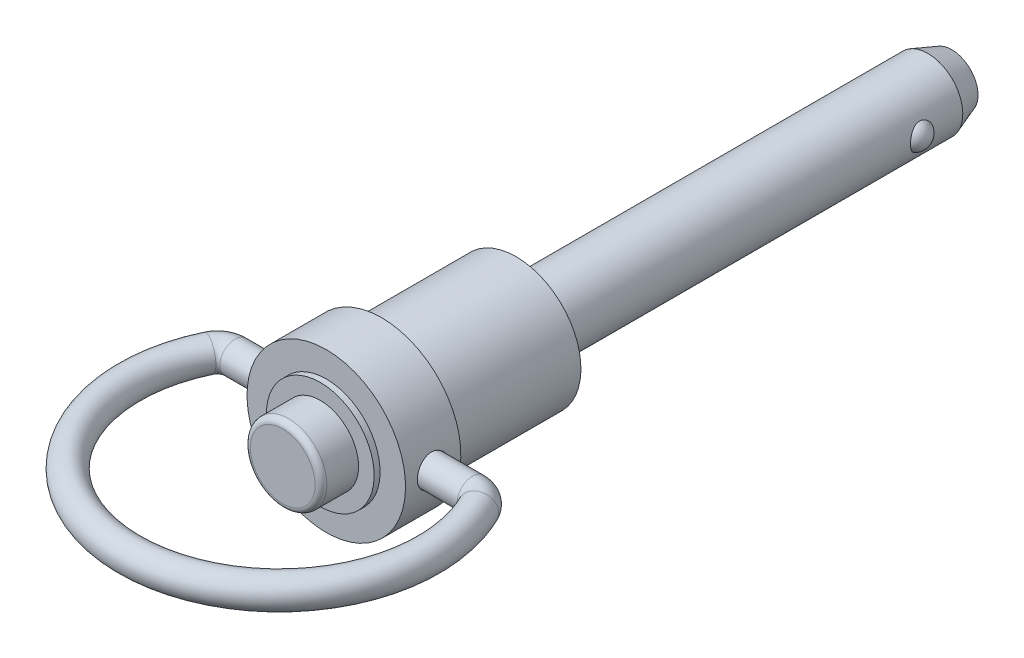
ISO-10303-21;
HEADER;
FILE_DESCRIPTION(('STEP AP214'),'2;1');
FILE_NAME('part.step','',(''),(''),'','','');
FILE_SCHEMA(('AUTOMOTIVE_DESIGN { 1 0 10303 214 1 1 1 1 }'));
ENDSEC;
DATA;
#1=APPLICATION_CONTEXT('core data for automotive mechanical design processes');
#2=APPLICATION_PROTOCOL_DEFINITION('international standard','automotive_design',2000,#1);
#3=PRODUCT_CONTEXT('',#1,'mechanical');
#4=PRODUCT('Part','Part','',(#3));
#5=PRODUCT_RELATED_PRODUCT_CATEGORY('part','',(#4));
#6=PRODUCT_DEFINITION_FORMATION('','',#4);
#7=PRODUCT_DEFINITION_CONTEXT('part definition',#1,'design');
#8=PRODUCT_DEFINITION('design','',#6,#7);
#9=PRODUCT_DEFINITION_SHAPE('','',#8);
#10=(LENGTH_UNIT() NAMED_UNIT(*) SI_UNIT(.MILLI.,.METRE.));
#11=(NAMED_UNIT(*) PLANE_ANGLE_UNIT() SI_UNIT($,.RADIAN.));
#12=(NAMED_UNIT(*) SI_UNIT($,.STERADIAN.) SOLID_ANGLE_UNIT());
#13=UNCERTAINTY_MEASURE_WITH_UNIT(LENGTH_MEASURE(1.E-05),#10,'distance_accuracy_value','');
#14=(GEOMETRIC_REPRESENTATION_CONTEXT(3) GLOBAL_UNCERTAINTY_ASSIGNED_CONTEXT((#13)) GLOBAL_UNIT_ASSIGNED_CONTEXT((#10,
#11,#12)) REPRESENTATION_CONTEXT('',''));
#15=CARTESIAN_POINT('',(0.,0.,0.));
#16=DIRECTION('',(0.,0.,1.));
#17=DIRECTION('',(1.,0.,0.));
#18=AXIS2_PLACEMENT_3D('',#15,#16,#17);
#19=CARTESIAN_POINT('',(0.,0.,20.828));
#20=DIRECTION('',(0.,0.,-1.));
#21=DIRECTION('',(0.,1.,0.));
#22=AXIS2_PLACEMENT_3D('',#19,#20,#21);
#23=CYLINDRICAL_SURFACE('',#22,3.2512);
#24=CARTESIAN_POINT('',(0.,0.,16.637));
#25=DIRECTION('',(0.,0.,-1.));
#26=DIRECTION('',(0.,1.,0.));
#27=AXIS2_PLACEMENT_3D('',#24,#25,#26);
#28=CIRCLE('',#27,3.2512);
#29=CARTESIAN_POINT('',(0.,3.2512,16.637));
#30=VERTEX_POINT('',#29);
#31=EDGE_CURVE('E135',#30,#30,#28,.T.);
#32=ORIENTED_EDGE('',*,*,#31,.F.);
#33=EDGE_LOOP('',(#32));
#34=FACE_BOUND('',#33,.T.);
#35=CARTESIAN_POINT('',(0.,0.,19.328));
#36=DIRECTION('',(0.,0.,1.));
#37=DIRECTION('',(1.,0.,0.));
#38=AXIS2_PLACEMENT_3D('',#35,#36,#37);
#39=CIRCLE('',#38,3.2512);
#40=CARTESIAN_POINT('',(3.2512,0.,19.328));
#41=VERTEX_POINT('',#40);
#42=EDGE_CURVE('E40',#41,#41,#39,.T.);
#43=ORIENTED_EDGE('',*,*,#42,.F.);
#44=EDGE_LOOP('',(#43));
#45=FACE_BOUND('',#44,.T.);
#46=ADVANCED_FACE('F13',(#34,#45),#23,.T.);
#47=CARTESIAN_POINT('',(4.572,0.,16.637));
#48=DIRECTION('',(0.,0.,1.));
#49=DIRECTION('',(0.,-1.,0.));
#50=AXIS2_PLACEMENT_3D('',#47,#48,#49);
#51=PLANE('',#50);
#52=ORIENTED_EDGE('',*,*,#31,.T.);
#53=EDGE_LOOP('',(#52));
#54=FACE_BOUND('',#53,.T.);
#55=CARTESIAN_POINT('',(0.,0.,16.637));
#56=DIRECTION('',(0.,0.,-1.));
#57=DIRECTION('',(0.,1.,0.));
#58=AXIS2_PLACEMENT_3D('',#55,#56,#57);
#59=CIRCLE('',#58,4.572);
#60=CARTESIAN_POINT('',(0.,4.572,16.637));
#61=VERTEX_POINT('',#60);
#62=EDGE_CURVE('E139',#61,#61,#59,.T.);
#63=ORIENTED_EDGE('',*,*,#62,.F.);
#64=EDGE_LOOP('',(#63));
#65=FACE_BOUND('',#64,.T.);
#66=ADVANCED_FACE('F86',(#54,#65),#51,.T.);
#67=CARTESIAN_POINT('',(0.,0.,0.));
#68=DIRECTION('',(0.,0.,-1.));
#69=DIRECTION('',(0.,1.,0.));
#70=AXIS2_PLACEMENT_3D('',#67,#68,#69);
#71=CYLINDRICAL_SURFACE('',#70,4.572);
#72=ORIENTED_EDGE('',*,*,#62,.T.);
#73=EDGE_LOOP('',(#72));
#74=FACE_BOUND('',#73,.T.);
#75=CARTESIAN_POINT('',(0.,0.,16.129));
#76=DIRECTION('',(0.,0.,-1.));
#77=DIRECTION('',(0.,1.,0.));
#78=AXIS2_PLACEMENT_3D('',#75,#76,#77);
#79=CIRCLE('',#78,4.572);
#80=CARTESIAN_POINT('',(0.,4.572,16.129));
#81=VERTEX_POINT('',#80);
#82=EDGE_CURVE('E105',#81,#81,#79,.T.);
#83=ORIENTED_EDGE('',*,*,#82,.F.);
#84=EDGE_LOOP('',(#83));
#85=FACE_BOUND('',#84,.T.);
#86=ADVANCED_FACE('F87',(#74,#85),#71,.T.);
#87=CARTESIAN_POINT('',(4.953,0.,13.7922));
#88=DIRECTION('',(1.,0.,0.));
#89=DIRECTION('',(0.,1.,0.));
#90=AXIS2_PLACEMENT_3D('',#87,#88,#89);
#91=CYLINDRICAL_SURFACE('',#90,1.3335);
#92=CARTESIAN_POINT('',(6.54749763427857,1.3335,13.7922));
#93=CARTESIAN_POINT('',(6.5474991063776,1.33349725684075,13.7181014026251));
#94=CARTESIAN_POINT('',(6.54876918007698,1.32730286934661,13.6439682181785));
#95=CARTESIAN_POINT('',(6.55370482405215,1.30270949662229,13.49779878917));
#96=CARTESIAN_POINT('',(6.55737231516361,1.28430072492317,13.4257642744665));
#97=CARTESIAN_POINT('',(6.56667126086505,1.23587194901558,13.2859280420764));
#98=CARTESIAN_POINT('',(6.57230076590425,1.20586346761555,13.2181222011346));
#99=CARTESIAN_POINT('',(6.58488711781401,1.13511860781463,13.0885094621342));
#100=CARTESIAN_POINT('',(6.59184388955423,1.09438283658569,13.0267022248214));
#101=CARTESIAN_POINT('',(6.60641035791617,1.00272829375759,12.9099675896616));
#102=CARTESIAN_POINT('',(6.61402719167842,0.951687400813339,12.8551369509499));
#103=CARTESIAN_POINT('',(6.62899273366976,0.84113532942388,12.7547566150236));
#104=CARTESIAN_POINT('',(6.63634142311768,0.781623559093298,12.7092075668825));
#105=CARTESIAN_POINT('',(6.65001963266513,0.655178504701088,12.6283080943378));
#106=CARTESIAN_POINT('',(6.65633975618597,0.588185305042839,12.5930495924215));
#107=CARTESIAN_POINT('',(6.66716856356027,0.449078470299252,12.5343252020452));
#108=CARTESIAN_POINT('',(6.67167741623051,0.376965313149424,12.5108582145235));
#109=CARTESIAN_POINT('',(6.67832523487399,0.230669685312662,12.4766841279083));
#110=CARTESIAN_POINT('',(6.68049451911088,0.156526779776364,12.465813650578));
#111=CARTESIAN_POINT('',(6.68232348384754,0.00743999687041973,12.4566314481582));
#112=CARTESIAN_POINT('',(6.68198340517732,-0.0675038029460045,12.4583185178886));
#113=CARTESIAN_POINT('',(6.67885546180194,-0.214942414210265,12.474079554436));
#114=CARTESIAN_POINT('',(6.67610237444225,-0.287456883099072,12.4879775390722));
#115=CARTESIAN_POINT('',(6.66849696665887,-0.429103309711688,12.5274867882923));
#116=CARTESIAN_POINT('',(6.66364456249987,-0.498235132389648,12.5530985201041));
#117=CARTESIAN_POINT('',(6.65232839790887,-0.63165620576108,12.6154714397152));
#118=CARTESIAN_POINT('',(6.64585471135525,-0.695912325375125,12.652301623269));
#119=CARTESIAN_POINT('',(6.63200971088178,-0.817397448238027,12.736014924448));
#120=CARTESIAN_POINT('',(6.62463829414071,-0.874625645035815,12.7828991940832));
#121=CARTESIAN_POINT('',(6.60966118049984,-0.981474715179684,12.8863553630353));
#122=CARTESIAN_POINT('',(6.60205363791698,-1.03094632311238,12.9430812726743));
#123=CARTESIAN_POINT('',(6.58758307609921,-1.11969856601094,13.0641010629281));
#124=CARTESIAN_POINT('',(6.58072007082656,-1.15897900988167,13.1283950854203));
#125=CARTESIAN_POINT('',(6.56851205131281,-1.2262850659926,13.2629398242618));
#126=CARTESIAN_POINT('',(6.56317029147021,-1.25428660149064,13.3332028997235));
#127=CARTESIAN_POINT('',(6.55465740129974,-1.2980430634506,13.4775678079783));
#128=CARTESIAN_POINT('',(6.55148598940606,-1.31379957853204,13.5516691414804));
#129=CARTESIAN_POINT('',(6.54772925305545,-1.33239582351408,13.70025449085));
#130=CARTESIAN_POINT('',(6.54710078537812,-1.33545106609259,13.7747104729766));
#131=CARTESIAN_POINT('',(6.54838530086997,-1.32913788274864,13.923068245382));
#132=CARTESIAN_POINT('',(6.55029814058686,-1.31977015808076,13.9969700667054));
#133=CARTESIAN_POINT('',(6.55640934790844,-1.28906272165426,14.14139787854));
#134=CARTESIAN_POINT('',(6.56058573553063,-1.26783808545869,14.21194935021));
#135=CARTESIAN_POINT('',(6.57073420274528,-1.21414232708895,14.348494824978));
#136=CARTESIAN_POINT('',(6.57670642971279,-1.18167028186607,14.4144884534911));
#137=CARTESIAN_POINT('',(6.58987062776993,-1.10591332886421,14.5409881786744));
#138=CARTESIAN_POINT('',(6.59707742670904,-1.06249352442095,14.6014119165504));
#139=CARTESIAN_POINT('',(6.61185802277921,-0.96625347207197,14.7141942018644));
#140=CARTESIAN_POINT('',(6.61943185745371,-0.913432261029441,14.7665519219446));
#141=CARTESIAN_POINT('',(6.6342331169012,-0.798921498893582,14.862532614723));
#142=CARTESIAN_POINT('',(6.64145348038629,-0.737108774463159,14.9060098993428));
#143=CARTESIAN_POINT('',(6.65461158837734,-0.60693131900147,14.9819623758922));
#144=CARTESIAN_POINT('',(6.66054938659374,-0.538566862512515,15.0144380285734));
#145=CARTESIAN_POINT('',(6.67044317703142,-0.397610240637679,15.0672528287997));
#146=CARTESIAN_POINT('',(6.67441035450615,-0.325044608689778,15.0876606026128));
#147=CARTESIAN_POINT('',(6.67996387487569,-0.177428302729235,15.1159778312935));
#148=CARTESIAN_POINT('',(6.68155050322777,-0.10237792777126,15.1238887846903));
#149=CARTESIAN_POINT('',(6.6821574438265,0.0466856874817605,15.126929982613));
#150=CARTESIAN_POINT('',(6.68122174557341,0.12069436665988,15.1222792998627));
#151=CARTESIAN_POINT('',(6.67698161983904,0.266852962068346,15.1008128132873));
#152=CARTESIAN_POINT('',(6.67367722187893,0.339002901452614,15.0839971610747));
#153=CARTESIAN_POINT('',(6.66507218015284,0.479260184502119,15.0387752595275));
#154=CARTESIAN_POINT('',(6.65977605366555,0.547376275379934,15.010395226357));
#155=CARTESIAN_POINT('',(6.64775792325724,0.677911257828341,14.9428778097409));
#156=CARTESIAN_POINT('',(6.64103580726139,0.740329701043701,14.9037395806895));
#157=CARTESIAN_POINT('',(6.62676868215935,0.85878104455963,14.8150772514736));
#158=CARTESIAN_POINT('',(6.61921218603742,0.914695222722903,14.7653963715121));
#159=CARTESIAN_POINT('',(6.60419634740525,1.01746854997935,14.657381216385));
#160=CARTESIAN_POINT('',(6.59673702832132,1.06432555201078,14.5990448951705));
#161=CARTESIAN_POINT('',(6.58267211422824,1.14813123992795,14.4746249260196));
#162=CARTESIAN_POINT('',(6.57607652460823,1.18496836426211,14.408464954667));
#163=CARTESIAN_POINT('',(6.56460799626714,1.24694455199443,14.2707814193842));
#164=CARTESIAN_POINT('',(6.55973349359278,1.27209424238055,14.1992627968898));
#165=CARTESIAN_POINT('',(6.55323358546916,1.30509663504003,14.071683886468));
#166=CARTESIAN_POINT('',(6.55109591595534,1.31572886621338,14.016351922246));
#167=CARTESIAN_POINT('',(6.54822740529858,1.32993146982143,13.9047532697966));
#168=CARTESIAN_POINT('',(6.54749651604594,1.3335020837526,13.8484866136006));
#169=CARTESIAN_POINT('',(6.54749763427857,1.3335,13.7922));
#170=B_SPLINE_CURVE_WITH_KNOTS('',3,(#92,#93,#94,#95,#96,#97,#98,#99,#100,#101,#102,#103,#104,
#105,#106,#107,#108,#109,#110,#111,#112,#113,#114,#115,#116,#117,#118,#119,#120,#121,#122,#123,
#124,#125,#126,#127,#128,#129,#130,#131,#132,#133,#134,#135,#136,#137,#138,#139,#140,#141,#142,
#143,#144,#145,#146,#147,#148,#149,#150,#151,#152,#153,#154,#155,#156,#157,#158,#159,#160,#161,
#162,#163,#164,#165,#166,#167,#168,#169),.UNSPECIFIED.,.T.,.F.,(4,2,2,2,2,2,2,2,2,2,2,2,2,2,2,2,
2,2,2,2,2,2,2,2,2,2,2,2,2,2,2,2,2,2,2,2,2,2,4),(0.,0.222089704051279,0.444357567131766,
0.666405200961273,0.888440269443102,1.11327983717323,1.33813512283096,1.56494147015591,
1.79172667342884,2.01553630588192,2.23932445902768,2.4599393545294,2.68056305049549,
2.9025720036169,3.12460640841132,3.35049429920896,3.57638642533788,3.80275823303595,
4.02910066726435,4.2515864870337,4.47405974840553,4.69441042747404,4.91477919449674,
5.13800871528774,5.36126111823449,5.58792474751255,5.81457888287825,6.03993139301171,
6.26525687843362,6.4866782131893,6.70809678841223,6.92901618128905,7.14995294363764,
7.37443982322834,7.5989798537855,7.8259261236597,8.05266563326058,8.22137469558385,
8.39007798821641),.UNSPECIFIED.);
#171=CARTESIAN_POINT('',(6.54749763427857,1.3335,13.7922));
#172=VERTEX_POINT('',#171);
#173=EDGE_CURVE('E39',#172,#172,#170,.T.);
#174=ORIENTED_EDGE('',*,*,#173,.T.);
#175=EDGE_LOOP('',(#174));
#176=FACE_BOUND('',#175,.T.);
#177=CARTESIAN_POINT('',(6.59758582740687,1.3335,13.7922));
#178=CARTESIAN_POINT('',(6.59758765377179,1.333496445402,13.718166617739));
#179=CARTESIAN_POINT('',(6.59884669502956,1.3273080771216,13.6440410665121));
#180=CARTESIAN_POINT('',(6.60374356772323,1.30272126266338,13.4978267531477));
#181=CARTESIAN_POINT('',(6.60738612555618,1.28429855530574,13.4257423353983));
#182=CARTESIAN_POINT('',(6.61662138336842,1.23583426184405,13.28583488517));
#183=CARTESIAN_POINT('',(6.622211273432,1.20580941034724,13.2180058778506));
#184=CARTESIAN_POINT('',(6.63470762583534,1.13503345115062,13.0883707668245));
#185=CARTESIAN_POINT('',(6.64161365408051,1.09428587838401,13.0265626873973));
#186=CARTESIAN_POINT('',(6.6560731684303,1.00260929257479,12.9098323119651));
#187=CARTESIAN_POINT('',(6.66363369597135,0.951558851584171,12.8550062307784));
#188=CARTESIAN_POINT('',(6.6784886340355,0.840985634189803,12.7546347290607));
#189=CARTESIAN_POINT('',(6.68578301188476,0.781461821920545,12.7090904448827));
#190=CARTESIAN_POINT('',(6.69935837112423,0.655004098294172,12.6282103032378));
#191=CARTESIAN_POINT('',(6.70563018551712,0.588011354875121,12.5929647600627));
#192=CARTESIAN_POINT('',(6.7163755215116,0.448910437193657,12.5342656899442));
#193=CARTESIAN_POINT('',(6.72084922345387,0.376802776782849,12.5108109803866));
#194=CARTESIAN_POINT('',(6.72744504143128,0.230507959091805,12.4766555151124));
#195=CARTESIAN_POINT('',(6.72959681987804,0.156359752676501,12.4657937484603));
#196=CARTESIAN_POINT('',(6.73140875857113,0.00726425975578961,12.4566302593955));
#197=CARTESIAN_POINT('',(6.73106915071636,-0.0676829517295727,12.4583273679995));
#198=CARTESIAN_POINT('',(6.72795960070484,-0.215142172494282,12.4741110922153));
#199=CARTESIAN_POINT('',(6.725223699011,-0.287673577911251,12.4880241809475));
#200=CARTESIAN_POINT('',(6.71766729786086,-0.429351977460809,12.5275699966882));
#201=CARTESIAN_POINT('',(6.71284670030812,-0.498498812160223,12.5532032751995));
#202=CARTESIAN_POINT('',(6.701606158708,-0.631943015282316,12.6156242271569));
#203=CARTESIAN_POINT('',(6.69517643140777,-0.696207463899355,12.6524804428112));
#204=CARTESIAN_POINT('',(6.68142742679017,-0.817699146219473,12.7362475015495));
#205=CARTESIAN_POINT('',(6.67410811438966,-0.874926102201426,12.7831587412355));
#206=CARTESIAN_POINT('',(6.65924190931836,-0.981743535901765,12.8866477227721));
#207=CARTESIAN_POINT('',(6.65169326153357,-1.03118836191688,12.9433756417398));
#208=CARTESIAN_POINT('',(6.63733339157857,-1.11990778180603,13.06442219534));
#209=CARTESIAN_POINT('',(6.63052249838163,-1.1591778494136,13.1287441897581));
#210=CARTESIAN_POINT('',(6.61840508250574,-1.22647971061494,13.2633777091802));
#211=CARTESIAN_POINT('',(6.61310290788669,-1.25447911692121,13.3337058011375));
#212=CARTESIAN_POINT('',(6.60466715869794,-1.29816626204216,13.4781072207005));
#213=CARTESIAN_POINT('',(6.6015290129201,-1.31387996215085,13.5521722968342));
#214=CARTESIAN_POINT('',(6.59896792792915,-1.32664627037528,13.6543666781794));
#215=CARTESIAN_POINT('',(6.59845085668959,-1.3292142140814,13.6818643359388));
#216=CARTESIAN_POINT('',(6.59775946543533,-1.33264174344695,13.7369703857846));
#217=CARTESIAN_POINT('',(6.59758514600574,-1.33350132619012,13.7645787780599));
#218=CARTESIAN_POINT('',(6.59758765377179,-1.333496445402,13.866233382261));
#219=CARTESIAN_POINT('',(6.59884669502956,-1.3273080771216,13.9403589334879));
#220=CARTESIAN_POINT('',(6.60374356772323,-1.30272126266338,14.0865732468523));
#221=CARTESIAN_POINT('',(6.60738612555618,-1.28429855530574,14.1586576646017));
#222=CARTESIAN_POINT('',(6.61662138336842,-1.23583426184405,14.29856511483));
#223=CARTESIAN_POINT('',(6.622211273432,-1.20580941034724,14.3663941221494));
#224=CARTESIAN_POINT('',(6.63470762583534,-1.13503345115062,14.4960292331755));
#225=CARTESIAN_POINT('',(6.64161365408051,-1.09428587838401,14.5578373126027));
#226=CARTESIAN_POINT('',(6.6560731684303,-1.00260929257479,14.6745676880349));
#227=CARTESIAN_POINT('',(6.66363369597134,-0.951558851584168,14.7293937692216));
#228=CARTESIAN_POINT('',(6.6784886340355,-0.840985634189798,14.8297652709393));
#229=CARTESIAN_POINT('',(6.68578301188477,-0.781461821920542,14.8753095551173));
#230=CARTESIAN_POINT('',(6.69935837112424,-0.655004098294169,14.9561896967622));
#231=CARTESIAN_POINT('',(6.70563018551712,-0.588011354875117,14.9914352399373));
#232=CARTESIAN_POINT('',(6.7163755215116,-0.448910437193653,15.0501343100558));
#233=CARTESIAN_POINT('',(6.72084922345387,-0.376802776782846,15.0735890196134));
#234=CARTESIAN_POINT('',(6.72744504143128,-0.230507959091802,15.1077444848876));
#235=CARTESIAN_POINT('',(6.72959681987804,-0.156359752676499,15.1186062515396));
#236=CARTESIAN_POINT('',(6.73140875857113,-0.00726425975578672,15.1277697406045));
#237=CARTESIAN_POINT('',(6.73106915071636,0.067682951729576,15.1260726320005));
#238=CARTESIAN_POINT('',(6.72795960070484,0.215142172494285,15.1102889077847));
#239=CARTESIAN_POINT('',(6.72522369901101,0.287673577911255,15.0963758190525));
#240=CARTESIAN_POINT('',(6.71766729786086,0.429351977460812,15.0568300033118));
#241=CARTESIAN_POINT('',(6.71284670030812,0.498498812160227,15.0311967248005));
#242=CARTESIAN_POINT('',(6.701606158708,0.631943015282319,14.9687757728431));
#243=CARTESIAN_POINT('',(6.69517643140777,0.696207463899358,14.9319195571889));
#244=CARTESIAN_POINT('',(6.68142742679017,0.817699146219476,14.8481524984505));
#245=CARTESIAN_POINT('',(6.67410811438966,0.874926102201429,14.8012412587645));
#246=CARTESIAN_POINT('',(6.65924190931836,0.981743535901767,14.6977522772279));
#247=CARTESIAN_POINT('',(6.65169326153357,1.03118836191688,14.6410243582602));
#248=CARTESIAN_POINT('',(6.63733339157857,1.11990778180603,14.51997780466));
#249=CARTESIAN_POINT('',(6.63052249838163,1.1591778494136,14.4556558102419));
#250=CARTESIAN_POINT('',(6.61840508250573,1.22647971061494,14.3210222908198));
#251=CARTESIAN_POINT('',(6.61310290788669,1.25447911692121,14.2506941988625));
#252=CARTESIAN_POINT('',(6.60466715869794,1.29816626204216,14.1062927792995));
#253=CARTESIAN_POINT('',(6.6015290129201,1.31387996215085,14.0322277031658));
#254=CARTESIAN_POINT('',(6.59896792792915,1.32664627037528,13.9300333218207));
#255=CARTESIAN_POINT('',(6.59845085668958,1.3292142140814,13.9025356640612));
#256=CARTESIAN_POINT('',(6.59775946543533,1.33264174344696,13.8474296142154));
#257=CARTESIAN_POINT('',(6.59758514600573,1.33350132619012,13.8198212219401));
#258=CARTESIAN_POINT('',(6.59758582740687,1.3335,13.7922));
#259=B_SPLINE_CURVE_WITH_KNOTS('',3,(#177,#178,#179,#180,#181,#182,#183,#184,#185,#186,#187,
#188,#189,#190,#191,#192,#193,#194,#195,#196,#197,#198,#199,#200,#201,#202,#203,#204,#205,#206,
#207,#208,#209,#210,#211,#212,#213,#214,#215,#216,#217,#218,#219,#220,#221,#222,#223,#224,#225,
#226,#227,#228,#229,#230,#231,#232,#233,#234,#235,#236,#237,#238,#239,#240,#241,#242,#243,#244,
#245,#246,#247,#248,#249,#250,#251,#252,#253,#254,#255,#256,#257,#258),.UNSPECIFIED.,.T.,.F.,(4,
2,2,2,2,2,2,2,2,2,2,2,2,2,2,2,2,2,2,2,2,2,2,2,2,2,2,2,2,2,2,2,2,2,2,2,2,2,2,2,4),(0.,
0.221994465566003,0.444430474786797,0.666546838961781,0.888590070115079,1.11342160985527,
1.33828065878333,1.56505617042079,1.79180893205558,2.01562934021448,2.23942891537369,
2.46009995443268,2.68078137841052,2.90283856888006,3.12490451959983,3.35072919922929,
3.5766541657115,3.80322379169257,4.02931334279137,4.11213743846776,4.19496167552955,
4.41695614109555,4.63939215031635,4.86150851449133,5.08355174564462,5.30838328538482,
5.53324233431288,5.76001784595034,5.98677060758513,6.21059101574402,6.43439059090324,
6.65506162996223,6.87574305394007,7.09780024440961,7.31986619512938,7.54569087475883,
7.77161584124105,7.99818546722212,8.22427501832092,8.30709911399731,8.38992335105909),.UNSPECIFIED.);
#260=CARTESIAN_POINT('',(6.59758582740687,1.3335,13.7922));
#261=VERTEX_POINT('',#260);
#262=EDGE_CURVE('E97',#261,#261,#259,.T.);
#263=ORIENTED_EDGE('',*,*,#262,.F.);
#264=EDGE_LOOP('',(#263));
#265=FACE_BOUND('',#264,.T.);
#266=ADVANCED_FACE('F89',(#176,#265),#91,.F.);
#267=CARTESIAN_POINT('',(-4.953,0.,13.7922));
#268=DIRECTION('',(-1.,0.,0.));
#269=DIRECTION('',(0.,-1.,0.));
#270=AXIS2_PLACEMENT_3D('',#267,#268,#269);
#271=CYLINDRICAL_SURFACE('',#270,1.3335);
#272=CARTESIAN_POINT('',(-6.54749763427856,-1.33350000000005,13.7922));
#273=CARTESIAN_POINT('',(-6.54749910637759,-1.3334972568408,13.7181014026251));
#274=CARTESIAN_POINT('',(-6.54876918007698,-1.32730286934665,13.6439682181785));
#275=CARTESIAN_POINT('',(-6.55370482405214,-1.30270949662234,13.49779878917));
#276=CARTESIAN_POINT('',(-6.5573723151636,-1.28430072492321,13.4257642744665));
#277=CARTESIAN_POINT('',(-6.56667126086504,-1.23587194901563,13.2859280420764));
#278=CARTESIAN_POINT('',(-6.57230076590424,-1.20586346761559,13.2181222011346));
#279=CARTESIAN_POINT('',(-6.58488711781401,-1.13511860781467,13.0885094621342));
#280=CARTESIAN_POINT('',(-6.59184388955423,-1.09438283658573,13.0267022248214));
#281=CARTESIAN_POINT('',(-6.60641035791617,-1.00272829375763,12.9099675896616));
#282=CARTESIAN_POINT('',(-6.61402719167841,-0.951687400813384,12.8551369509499));
#283=CARTESIAN_POINT('',(-6.62899273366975,-0.841135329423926,12.7547566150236));
#284=CARTESIAN_POINT('',(-6.63634142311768,-0.781623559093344,12.7092075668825));
#285=CARTESIAN_POINT('',(-6.65001963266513,-0.655178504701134,12.6283080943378));
#286=CARTESIAN_POINT('',(-6.65633975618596,-0.588185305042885,12.5930495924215));
#287=CARTESIAN_POINT('',(-6.66716856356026,-0.449078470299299,12.5343252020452));
#288=CARTESIAN_POINT('',(-6.67167741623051,-0.376965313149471,12.5108582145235));
#289=CARTESIAN_POINT('',(-6.67832523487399,-0.230669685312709,12.4766841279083));
#290=CARTESIAN_POINT('',(-6.68049451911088,-0.156526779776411,12.465813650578));
#291=CARTESIAN_POINT('',(-6.68232348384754,-0.00743999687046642,12.4566314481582));
#292=CARTESIAN_POINT('',(-6.68198340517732,0.0675038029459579,12.4583185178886));
#293=CARTESIAN_POINT('',(-6.67885546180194,0.214942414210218,12.474079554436));
#294=CARTESIAN_POINT('',(-6.67610237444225,0.287456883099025,12.4879775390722));
#295=CARTESIAN_POINT('',(-6.66849696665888,0.429103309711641,12.5274867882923));
#296=CARTESIAN_POINT('',(-6.66364456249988,0.498235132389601,12.5530985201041));
#297=CARTESIAN_POINT('',(-6.65232839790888,0.631656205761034,12.6154714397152));
#298=CARTESIAN_POINT('',(-6.64585471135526,0.695912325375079,12.652301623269));
#299=CARTESIAN_POINT('',(-6.63200971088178,0.81739744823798,12.736014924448));
#300=CARTESIAN_POINT('',(-6.62463829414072,0.874625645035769,12.7828991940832));
#301=CARTESIAN_POINT('',(-6.60966118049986,0.981474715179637,12.8863553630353));
#302=CARTESIAN_POINT('',(-6.60205363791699,1.03094632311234,12.9430812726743));
#303=CARTESIAN_POINT('',(-6.58758307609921,1.11969856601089,13.0641010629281));
#304=CARTESIAN_POINT('',(-6.58072007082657,1.15897900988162,13.1283950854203));
#305=CARTESIAN_POINT('',(-6.56851205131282,1.22628506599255,13.2629398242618));
#306=CARTESIAN_POINT('',(-6.56317029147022,1.25428660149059,13.3332028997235));
#307=CARTESIAN_POINT('',(-6.55465740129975,1.29804306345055,13.4775678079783));
#308=CARTESIAN_POINT('',(-6.55148598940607,1.31379957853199,13.5516691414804));
#309=CARTESIAN_POINT('',(-6.54772925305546,1.33239582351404,13.70025449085));
#310=CARTESIAN_POINT('',(-6.54710078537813,1.33545106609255,13.7747104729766));
#311=CARTESIAN_POINT('',(-6.54838530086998,1.32913788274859,13.923068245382));
#312=CARTESIAN_POINT('',(-6.55029814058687,1.31977015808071,13.9969700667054));
#313=CARTESIAN_POINT('',(-6.55640934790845,1.28906272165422,14.14139787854));
#314=CARTESIAN_POINT('',(-6.56058573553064,1.26783808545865,14.21194935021));
#315=CARTESIAN_POINT('',(-6.57073420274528,1.2141423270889,14.348494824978));
#316=CARTESIAN_POINT('',(-6.57670642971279,1.18167028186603,14.4144884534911));
#317=CARTESIAN_POINT('',(-6.58987062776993,1.10591332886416,14.5409881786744));
#318=CARTESIAN_POINT('',(-6.59707742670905,1.0624935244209,14.6014119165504));
#319=CARTESIAN_POINT('',(-6.61185802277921,0.966253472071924,14.7141942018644));
#320=CARTESIAN_POINT('',(-6.61943185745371,0.913432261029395,14.7665519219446));
#321=CARTESIAN_POINT('',(-6.6342331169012,0.798921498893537,14.862532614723));
#322=CARTESIAN_POINT('',(-6.64145348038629,0.737108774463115,14.9060098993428));
#323=CARTESIAN_POINT('',(-6.65461158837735,0.606931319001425,14.9819623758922));
#324=CARTESIAN_POINT('',(-6.66054938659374,0.53856686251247,15.0144380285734));
#325=CARTESIAN_POINT('',(-6.67044317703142,0.397610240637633,15.0672528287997));
#326=CARTESIAN_POINT('',(-6.67441035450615,0.325044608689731,15.0876606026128));
#327=CARTESIAN_POINT('',(-6.67996387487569,0.177428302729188,15.1159778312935));
#328=CARTESIAN_POINT('',(-6.68155050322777,0.102377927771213,15.1238887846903));
#329=CARTESIAN_POINT('',(-6.6821574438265,-0.0466856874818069,15.126929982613));
#330=CARTESIAN_POINT('',(-6.68122174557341,-0.120694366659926,15.1222792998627));
#331=CARTESIAN_POINT('',(-6.67698161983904,-0.266852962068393,15.1008128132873));
#332=CARTESIAN_POINT('',(-6.67367722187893,-0.33900290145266,15.0839971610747));
#333=CARTESIAN_POINT('',(-6.66507218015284,-0.479260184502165,15.0387752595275));
#334=CARTESIAN_POINT('',(-6.65977605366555,-0.547376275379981,15.010395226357));
#335=CARTESIAN_POINT('',(-6.64775792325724,-0.677911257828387,14.9428778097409));
#336=CARTESIAN_POINT('',(-6.64103580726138,-0.740329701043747,14.9037395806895));
#337=CARTESIAN_POINT('',(-6.62676868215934,-0.858781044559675,14.8150772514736));
#338=CARTESIAN_POINT('',(-6.61921218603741,-0.914695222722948,14.7653963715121));
#339=CARTESIAN_POINT('',(-6.60419634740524,-1.01746854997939,14.657381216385));
#340=CARTESIAN_POINT('',(-6.59673702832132,-1.06432555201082,14.5990448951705));
#341=CARTESIAN_POINT('',(-6.58267211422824,-1.148131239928,14.4746249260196));
#342=CARTESIAN_POINT('',(-6.57607652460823,-1.18496836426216,14.408464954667));
#343=CARTESIAN_POINT('',(-6.56460799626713,-1.24694455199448,14.2707814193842));
#344=CARTESIAN_POINT('',(-6.55973349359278,-1.27209424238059,14.1992627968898));
#345=CARTESIAN_POINT('',(-6.55323358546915,-1.30509663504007,14.071683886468));
#346=CARTESIAN_POINT('',(-6.55109591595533,-1.31572886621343,14.016351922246));
#347=CARTESIAN_POINT('',(-6.54822740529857,-1.32993146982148,13.9047532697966));
#348=CARTESIAN_POINT('',(-6.54749651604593,-1.33350208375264,13.8484866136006));
#349=CARTESIAN_POINT('',(-6.54749763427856,-1.33350000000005,13.7922));
#350=B_SPLINE_CURVE_WITH_KNOTS('',3,(#272,#273,#274,#275,#276,#277,#278,#279,#280,#281,#282,
#283,#284,#285,#286,#287,#288,#289,#290,#291,#292,#293,#294,#295,#296,#297,#298,#299,#300,#301,
#302,#303,#304,#305,#306,#307,#308,#309,#310,#311,#312,#313,#314,#315,#316,#317,#318,#319,#320,
#321,#322,#323,#324,#325,#326,#327,#328,#329,#330,#331,#332,#333,#334,#335,#336,#337,#338,#339,
#340,#341,#342,#343,#344,#345,#346,#347,#348,#349),.UNSPECIFIED.,.T.,.F.,(4,2,2,2,2,2,2,2,2,2,2,
2,2,2,2,2,2,2,2,2,2,2,2,2,2,2,2,2,2,2,2,2,2,2,2,2,2,2,4),(0.,0.22208970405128,0.444357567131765,
0.666405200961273,0.888440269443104,1.11327983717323,1.33813512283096,1.56494147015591,
1.79172667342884,2.01553630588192,2.23932445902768,2.4599393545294,2.68056305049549,
2.9025720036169,3.12460640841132,3.35049429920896,3.57638642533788,3.80275823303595,
4.02910066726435,4.2515864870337,4.47405974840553,4.69441042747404,4.91477919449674,
5.13800871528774,5.36126111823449,5.58792474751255,5.81457888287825,6.03993139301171,
6.26525687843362,6.48667821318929,6.70809678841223,6.92901618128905,7.14995294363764,
7.37443982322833,7.5989798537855,7.8259261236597,8.05266563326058,8.22137469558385,
8.3900779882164),.UNSPECIFIED.);
#351=CARTESIAN_POINT('',(-6.54749763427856,-1.33350000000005,13.7922));
#352=VERTEX_POINT('',#351);
#353=EDGE_CURVE('E31',#352,#352,#350,.T.);
#354=ORIENTED_EDGE('',*,*,#353,.T.);
#355=EDGE_LOOP('',(#354));
#356=FACE_BOUND('',#355,.T.);
#357=CARTESIAN_POINT('',(-6.59758582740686,-1.33350000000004,13.7922));
#358=CARTESIAN_POINT('',(-6.59758765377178,-1.33349644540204,13.718166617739));
#359=CARTESIAN_POINT('',(-6.59884669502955,-1.32730807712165,13.6440410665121));
#360=CARTESIAN_POINT('',(-6.60374356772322,-1.30272126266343,13.4978267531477));
#361=CARTESIAN_POINT('',(-6.60738612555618,-1.28429855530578,13.4257423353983));
#362=CARTESIAN_POINT('',(-6.61662138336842,-1.2358342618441,13.28583488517));
#363=CARTESIAN_POINT('',(-6.62221127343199,-1.20580941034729,13.2180058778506));
#364=CARTESIAN_POINT('',(-6.63470762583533,-1.13503345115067,13.0883707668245));
#365=CARTESIAN_POINT('',(-6.64161365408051,-1.09428587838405,13.0265626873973));
#366=CARTESIAN_POINT('',(-6.6560731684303,-1.00260929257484,12.9098323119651));
#367=CARTESIAN_POINT('',(-6.66363369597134,-0.951558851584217,12.8550062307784));
#368=CARTESIAN_POINT('',(-6.67848863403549,-0.840985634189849,12.7546347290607));
#369=CARTESIAN_POINT('',(-6.68578301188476,-0.781461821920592,12.7090904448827));
#370=CARTESIAN_POINT('',(-6.69935837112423,-0.655004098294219,12.6282103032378));
#371=CARTESIAN_POINT('',(-6.70563018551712,-0.588011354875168,12.5929647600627));
#372=CARTESIAN_POINT('',(-6.71637552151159,-0.448910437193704,12.5342656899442));
#373=CARTESIAN_POINT('',(-6.72084922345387,-0.376802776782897,12.5108109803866));
#374=CARTESIAN_POINT('',(-6.72744504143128,-0.230507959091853,12.4766555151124));
#375=CARTESIAN_POINT('',(-6.72959681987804,-0.156359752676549,12.4657937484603));
#376=CARTESIAN_POINT('',(-6.73140875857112,-0.00726425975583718,12.4566302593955));
#377=CARTESIAN_POINT('',(-6.73106915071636,0.0676829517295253,12.4583273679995));
#378=CARTESIAN_POINT('',(-6.72795960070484,0.215142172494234,12.4741110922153));
#379=CARTESIAN_POINT('',(-6.72522369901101,0.287673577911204,12.4880241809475));
#380=CARTESIAN_POINT('',(-6.71766729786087,0.429351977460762,12.5275699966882));
#381=CARTESIAN_POINT('',(-6.71284670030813,0.498498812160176,12.5532032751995));
#382=CARTESIAN_POINT('',(-6.70160615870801,0.631943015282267,12.6156242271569));
#383=CARTESIAN_POINT('',(-6.69517643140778,0.696207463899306,12.6524804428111));
#384=CARTESIAN_POINT('',(-6.68142742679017,0.817699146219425,12.7362475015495));
#385=CARTESIAN_POINT('',(-6.67410811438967,0.874926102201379,12.7831587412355));
#386=CARTESIAN_POINT('',(-6.65924190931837,0.981743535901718,12.8866477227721));
#387=CARTESIAN_POINT('',(-6.65169326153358,1.03118836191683,12.9433756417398));
#388=CARTESIAN_POINT('',(-6.63733339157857,1.11990778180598,13.06442219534));
#389=CARTESIAN_POINT('',(-6.63052249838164,1.15917784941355,13.1287441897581));
#390=CARTESIAN_POINT('',(-6.61840508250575,1.22647971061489,13.2633777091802));
#391=CARTESIAN_POINT('',(-6.6131029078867,1.25447911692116,13.3337058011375));
#392=CARTESIAN_POINT('',(-6.60466715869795,1.29816626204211,13.4781072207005));
#393=CARTESIAN_POINT('',(-6.60152901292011,1.31387996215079,13.5521722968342));
#394=CARTESIAN_POINT('',(-6.59896792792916,1.32664627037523,13.6543666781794));
#395=CARTESIAN_POINT('',(-6.59845085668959,1.32921421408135,13.6818643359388));
#396=CARTESIAN_POINT('',(-6.59775946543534,1.33264174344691,13.7369703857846));
#397=CARTESIAN_POINT('',(-6.59758514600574,1.33350132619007,13.7645787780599));
#398=CARTESIAN_POINT('',(-6.5975876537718,1.33349644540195,13.866233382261));
#399=CARTESIAN_POINT('',(-6.59884669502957,1.32730807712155,13.9403589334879));
#400=CARTESIAN_POINT('',(-6.60374356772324,1.30272126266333,14.0865732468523));
#401=CARTESIAN_POINT('',(-6.60738612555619,1.28429855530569,14.1586576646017));
#402=CARTESIAN_POINT('',(-6.61662138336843,1.235834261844,14.29856511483));
#403=CARTESIAN_POINT('',(-6.62221127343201,1.20580941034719,14.3663941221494));
#404=CARTESIAN_POINT('',(-6.63470762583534,1.13503345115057,14.4960292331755));
#405=CARTESIAN_POINT('',(-6.64161365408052,1.09428587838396,14.5578373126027));
#406=CARTESIAN_POINT('',(-6.65607316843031,1.00260929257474,14.6745676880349));
#407=CARTESIAN_POINT('',(-6.66363369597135,0.95155885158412,14.7293937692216));
#408=CARTESIAN_POINT('',(-6.67848863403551,0.840985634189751,14.8297652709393));
#409=CARTESIAN_POINT('',(-6.68578301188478,0.781461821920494,14.8753095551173));
#410=CARTESIAN_POINT('',(-6.69935837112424,0.655004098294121,14.9561896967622));
#411=CARTESIAN_POINT('',(-6.70563018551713,0.58801135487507,14.9914352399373));
#412=CARTESIAN_POINT('',(-6.7163755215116,0.448910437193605,15.0501343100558));
#413=CARTESIAN_POINT('',(-6.72084922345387,0.376802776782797,15.0735890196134));
#414=CARTESIAN_POINT('',(-6.72744504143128,0.230507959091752,15.1077444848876));
#415=CARTESIAN_POINT('',(-6.72959681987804,0.156359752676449,15.1186062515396));
#416=CARTESIAN_POINT('',(-6.73140875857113,0.0072642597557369,15.1277697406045));
#417=CARTESIAN_POINT('',(-6.73106915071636,-0.0676829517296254,15.1260726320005));
#418=CARTESIAN_POINT('',(-6.72795960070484,-0.215142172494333,15.1102889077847));
#419=CARTESIAN_POINT('',(-6.725223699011,-0.287673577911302,15.0963758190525));
#420=CARTESIAN_POINT('',(-6.71766729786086,-0.42935197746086,15.0568300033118));
#421=CARTESIAN_POINT('',(-6.71284670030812,-0.498498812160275,15.0311967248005));
#422=CARTESIAN_POINT('',(-6.701606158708,-0.631943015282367,14.9687757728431));
#423=CARTESIAN_POINT('',(-6.69517643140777,-0.696207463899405,14.9319195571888));
#424=CARTESIAN_POINT('',(-6.68142742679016,-0.817699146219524,14.8481524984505));
#425=CARTESIAN_POINT('',(-6.67410811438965,-0.874926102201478,14.8012412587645));
#426=CARTESIAN_POINT('',(-6.65924190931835,-0.981743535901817,14.6977522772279));
#427=CARTESIAN_POINT('',(-6.65169326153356,-1.03118836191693,14.6410243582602));
#428=CARTESIAN_POINT('',(-6.63733339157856,-1.11990778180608,14.51997780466));
#429=CARTESIAN_POINT('',(-6.63052249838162,-1.15917784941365,14.4556558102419));
#430=CARTESIAN_POINT('',(-6.61840508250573,-1.22647971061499,14.3210222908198));
#431=CARTESIAN_POINT('',(-6.61310290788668,-1.25447911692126,14.2506941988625));
#432=CARTESIAN_POINT('',(-6.60466715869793,-1.2981662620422,14.1062927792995));
#433=CARTESIAN_POINT('',(-6.60152901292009,-1.31387996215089,14.0322277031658));
#434=CARTESIAN_POINT('',(-6.59896792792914,-1.32664627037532,13.9300333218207));
#435=CARTESIAN_POINT('',(-6.59845085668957,-1.32921421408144,13.9025356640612));
#436=CARTESIAN_POINT('',(-6.59775946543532,-1.332641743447,13.8474296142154));
#437=CARTESIAN_POINT('',(-6.59758514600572,-1.33350132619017,13.8198212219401));
#438=CARTESIAN_POINT('',(-6.59758582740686,-1.33350000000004,13.7922));
#439=B_SPLINE_CURVE_WITH_KNOTS('',3,(#357,#358,#359,#360,#361,#362,#363,#364,#365,#366,#367,
#368,#369,#370,#371,#372,#373,#374,#375,#376,#377,#378,#379,#380,#381,#382,#383,#384,#385,#386,
#387,#388,#389,#390,#391,#392,#393,#394,#395,#396,#397,#398,#399,#400,#401,#402,#403,#404,#405,
#406,#407,#408,#409,#410,#411,#412,#413,#414,#415,#416,#417,#418,#419,#420,#421,#422,#423,#424,
#425,#426,#427,#428,#429,#430,#431,#432,#433,#434,#435,#436,#437,#438),.UNSPECIFIED.,.T.,.F.,(4,
2,2,2,2,2,2,2,2,2,2,2,2,2,2,2,2,2,2,2,2,2,2,2,2,2,2,2,2,2,2,2,2,2,2,2,2,2,2,2,4),(0.,
0.221994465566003,0.444430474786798,0.66654683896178,0.888590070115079,1.11342160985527,
1.33828065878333,1.56505617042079,1.79180893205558,2.01562934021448,2.23942891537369,
2.46009995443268,2.68078137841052,2.90283856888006,3.12490451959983,3.35072919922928,
3.5766541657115,3.80322379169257,4.02931334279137,4.11213743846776,4.19496167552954,
4.41695614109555,4.63939215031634,4.86150851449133,5.08355174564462,5.30838328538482,
5.53324233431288,5.76001784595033,5.98677060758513,6.21059101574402,6.43439059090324,
6.65506162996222,6.87574305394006,7.09780024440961,7.31986619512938,7.54569087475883,
7.77161584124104,7.99818546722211,8.22427501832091,8.3070991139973,8.38992335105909),.UNSPECIFIED.);
#440=CARTESIAN_POINT('',(-6.59758582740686,-1.33350000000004,13.7922));
#441=VERTEX_POINT('',#440);
#442=EDGE_CURVE('E116',#441,#441,#439,.T.);
#443=ORIENTED_EDGE('',*,*,#442,.F.);
#444=EDGE_LOOP('',(#443));
#445=FACE_BOUND('',#444,.T.);
#446=ADVANCED_FACE('F43',(#356,#445),#271,.F.);
#447=CARTESIAN_POINT('',(6.731,0.,16.129));
#448=DIRECTION('',(0.,0.,1.));
#449=DIRECTION('',(0.,-1.,0.));
#450=AXIS2_PLACEMENT_3D('',#447,#448,#449);
#451=PLANE('',#450);
#452=CARTESIAN_POINT('',(0.,0.,16.129));
#453=DIRECTION('',(0.,0.,-1.));
#454=DIRECTION('',(0.,1.,0.));
#455=AXIS2_PLACEMENT_3D('',#452,#453,#454);
#456=CIRCLE('',#455,6.731);
#457=CARTESIAN_POINT('',(0.,6.731,16.129));
#458=VERTEX_POINT('',#457);
#459=EDGE_CURVE('E104',#458,#458,#456,.T.);
#460=ORIENTED_EDGE('',*,*,#459,.F.);
#461=EDGE_LOOP('',(#460));
#462=FACE_BOUND('',#461,.T.);
#463=ORIENTED_EDGE('',*,*,#82,.T.);
#464=EDGE_LOOP('',(#463));
#465=FACE_BOUND('',#464,.T.);
#466=ADVANCED_FACE('F94',(#462,#465),#451,.T.);
#467=CARTESIAN_POINT('',(0.,0.,0.));
#468=DIRECTION('',(0.,0.,-1.));
#469=DIRECTION('',(0.,1.,0.));
#470=AXIS2_PLACEMENT_3D('',#467,#468,#469);
#471=CYLINDRICAL_SURFACE('',#470,6.731);
#472=ORIENTED_EDGE('',*,*,#459,.T.);
#473=EDGE_LOOP('',(#472));
#474=FACE_BOUND('',#473,.T.);
#475=ORIENTED_EDGE('',*,*,#442,.T.);
#476=EDGE_LOOP('',(#475));
#477=FACE_BOUND('',#476,.T.);
#478=CARTESIAN_POINT('',(0.,0.,11.43));
#479=DIRECTION('',(0.,0.,-1.));
#480=DIRECTION('',(0.,1.,0.));
#481=AXIS2_PLACEMENT_3D('',#478,#479,#480);
#482=CIRCLE('',#481,6.731);
#483=CARTESIAN_POINT('',(0.,6.731,11.43));
#484=VERTEX_POINT('',#483);
#485=EDGE_CURVE('E122',#484,#484,#482,.T.);
#486=ORIENTED_EDGE('',*,*,#485,.F.);
#487=EDGE_LOOP('',(#486));
#488=FACE_BOUND('',#487,.T.);
#489=ORIENTED_EDGE('',*,*,#262,.T.);
#490=EDGE_LOOP('',(#489));
#491=FACE_BOUND('',#490,.T.);
#492=ADVANCED_FACE('F108',(#474,#477,#488,#491),#471,.T.);
#493=CARTESIAN_POINT('',(5.7785,0.,11.43));
#494=DIRECTION('',(0.,0.,-1.));
#495=DIRECTION('',(0.,1.,0.));
#496=AXIS2_PLACEMENT_3D('',#493,#494,#495);
#497=PLANE('',#496);
#498=CARTESIAN_POINT('',(0.,0.,11.43));
#499=DIRECTION('',(0.,0.,-1.));
#500=DIRECTION('',(0.,1.,0.));
#501=AXIS2_PLACEMENT_3D('',#498,#499,#500);
#502=CIRCLE('',#501,5.9);
#503=CARTESIAN_POINT('',(0.,5.9,11.43));
#504=VERTEX_POINT('',#503);
#505=EDGE_CURVE('E20',#504,#504,#502,.F.);
#506=ORIENTED_EDGE('',*,*,#505,.T.);
#507=EDGE_LOOP('',(#506));
#508=FACE_BOUND('',#507,.T.);
#509=ORIENTED_EDGE('',*,*,#485,.T.);
#510=EDGE_LOOP('',(#509));
#511=FACE_BOUND('',#510,.T.);
#512=ADVANCED_FACE('F112',(#508,#511),#497,.T.);
#513=CARTESIAN_POINT('',(0.,0.,22.9456390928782));
#514=DIRECTION('',(0.,0.,1.));
#515=DIRECTION('',(1.,0.,0.));
#516=AXIS2_PLACEMENT_3D('',#513,#514,#515);
#517=CYLINDRICAL_SURFACE('',#516,6.6819119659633);
#518=CARTESIAN_POINT('',(-6.5551419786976,1.2954,13.7922));
#519=CARTESIAN_POINT('',(-6.55514339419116,1.29539728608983,13.8642257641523));
#520=CARTESIAN_POINT('',(-6.55634197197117,1.28937253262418,13.9362862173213));
#521=CARTESIAN_POINT('',(-6.56100027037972,1.26545087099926,14.0783718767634));
#522=CARTESIAN_POINT('',(-6.56446185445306,1.24754417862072,14.148395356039));
#523=CARTESIAN_POINT('',(-6.57323972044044,1.20043201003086,14.2843307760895));
#524=CARTESIAN_POINT('',(-6.57855421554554,1.17123741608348,14.35024660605));
#525=CARTESIAN_POINT('',(-6.59043697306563,1.10240749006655,14.4762417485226));
#526=CARTESIAN_POINT('',(-6.59700515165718,1.06277285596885,14.5363214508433));
#527=CARTESIAN_POINT('',(-6.61075275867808,0.973626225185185,14.6497414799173));
#528=CARTESIAN_POINT('',(-6.61793854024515,0.924002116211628,14.7029929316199));
#529=CARTESIAN_POINT('',(-6.63205568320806,0.816527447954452,14.8004697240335));
#530=CARTESIAN_POINT('',(-6.63898702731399,0.758676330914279,14.8446944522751));
#531=CARTESIAN_POINT('',(-6.65188261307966,0.635803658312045,14.923205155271));
#532=CARTESIAN_POINT('',(-6.65783849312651,0.570727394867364,14.957407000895));
#533=CARTESIAN_POINT('',(-6.66804084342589,0.435617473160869,15.0143586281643));
#534=CARTESIAN_POINT('',(-6.67228746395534,0.36558425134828,15.0371094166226));
#535=CARTESIAN_POINT('',(-6.6785479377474,0.223470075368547,15.0702373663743));
#536=CARTESIAN_POINT('',(-6.68058882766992,0.151425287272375,15.0807644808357));
#537=CARTESIAN_POINT('',(-6.68230117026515,0.00656517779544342,15.0896137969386));
#538=CARTESIAN_POINT('',(-6.68197283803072,-0.0662500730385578,15.087937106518));
#539=CARTESIAN_POINT('',(-6.67900476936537,-0.209554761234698,15.0725407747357));
#540=CARTESIAN_POINT('',(-6.67639602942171,-0.280062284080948,15.0589826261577));
#541=CARTESIAN_POINT('',(-6.66919512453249,-0.417782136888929,15.020464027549));
#542=CARTESIAN_POINT('',(-6.66460288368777,-0.484994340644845,14.9955031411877));
#543=CARTESIAN_POINT('',(-6.65389951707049,-0.61468019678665,14.9347358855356));
#544=CARTESIAN_POINT('',(-6.6477794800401,-0.677123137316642,14.8988656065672));
#545=CARTESIAN_POINT('',(-6.63469626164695,-0.795163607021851,14.8173449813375));
#546=CARTESIAN_POINT('',(-6.62773298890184,-0.850760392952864,14.7716935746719));
#547=CARTESIAN_POINT('',(-6.61359886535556,-0.954487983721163,14.6710186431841));
#548=CARTESIAN_POINT('',(-6.60642648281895,-1.00248152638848,14.6158538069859));
#549=CARTESIAN_POINT('',(-6.59279115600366,-1.08855740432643,14.4981869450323));
#550=CARTESIAN_POINT('',(-6.58632822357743,-1.12663957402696,14.435684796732));
#551=CARTESIAN_POINT('',(-6.574840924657,-1.19185492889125,14.3049279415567));
#552=CARTESIAN_POINT('',(-6.56981933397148,-1.21896702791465,14.236662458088));
#553=CARTESIAN_POINT('',(-6.5618248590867,-1.26129724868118,14.0964255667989));
#554=CARTESIAN_POINT('',(-6.55885172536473,-1.2765168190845,14.0244546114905));
#555=CARTESIAN_POINT('',(-6.55534047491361,-1.29442717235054,13.8800906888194));
#556=CARTESIAN_POINT('',(-6.55476393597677,-1.29731566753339,13.8077231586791));
#557=CARTESIAN_POINT('',(-6.55600817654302,-1.2910128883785,13.6635400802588));
#558=CARTESIAN_POINT('',(-6.55782882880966,-1.28182225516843,13.5917245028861));
#559=CARTESIAN_POINT('',(-6.56362642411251,-1.25179220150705,13.4513412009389));
#560=CARTESIAN_POINT('',(-6.56758398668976,-1.23105742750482,13.3827502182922));
#561=CARTESIAN_POINT('',(-6.57719263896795,-1.17863914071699,13.250015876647));
#562=CARTESIAN_POINT('',(-6.58284386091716,-1.14695477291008,13.1858728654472));
#563=CARTESIAN_POINT('',(-6.59528998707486,-1.07308541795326,13.0629871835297));
#564=CARTESIAN_POINT('',(-6.6020980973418,-1.03077612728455,13.0043205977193));
#565=CARTESIAN_POINT('',(-6.61605421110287,-0.937024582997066,12.8948479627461));
#566=CARTESIAN_POINT('',(-6.62320224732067,-0.885581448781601,12.8440426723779));
#567=CARTESIAN_POINT('',(-6.63715689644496,-0.774137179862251,12.7509906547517));
#568=CARTESIAN_POINT('',(-6.64395713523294,-0.714023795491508,12.7088772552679));
#569=CARTESIAN_POINT('',(-6.65634095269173,-0.587460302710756,12.6353478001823));
#570=CARTESIAN_POINT('',(-6.66192458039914,-0.521010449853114,12.6039313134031));
#571=CARTESIAN_POINT('',(-6.67121873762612,-0.384019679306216,12.5528844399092));
#572=CARTESIAN_POINT('',(-6.67493943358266,-0.313503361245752,12.5331899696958));
#573=CARTESIAN_POINT('',(-6.68013199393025,-0.170084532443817,12.505942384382));
#574=CARTESIAN_POINT('',(-6.68160411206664,-0.0971822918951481,12.4983878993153));
#575=CARTESIAN_POINT('',(-6.68212812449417,0.0476629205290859,12.4956851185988));
#576=CARTESIAN_POINT('',(-6.68121921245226,0.119602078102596,12.5003359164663));
#577=CARTESIAN_POINT('',(-6.67716521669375,0.261653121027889,12.5214698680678));
#578=CARTESIAN_POINT('',(-6.67402015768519,0.331765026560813,12.5379528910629));
#579=CARTESIAN_POINT('',(-6.66584779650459,0.46805560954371,12.5821963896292));
#580=CARTESIAN_POINT('',(-6.66082429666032,0.534241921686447,12.6099340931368));
#581=CARTESIAN_POINT('',(-6.64943739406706,0.661050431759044,12.6758748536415));
#582=CARTESIAN_POINT('',(-6.64307389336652,0.721672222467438,12.7140786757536));
#583=CARTESIAN_POINT('',(-6.62958563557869,0.836628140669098,12.8005518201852));
#584=CARTESIAN_POINT('',(-6.6224507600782,0.890852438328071,12.8489655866));
#585=CARTESIAN_POINT('',(-6.60828584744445,0.990476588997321,12.9541860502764));
#586=CARTESIAN_POINT('',(-6.60125583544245,1.03587435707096,13.0109947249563));
#587=CARTESIAN_POINT('',(-6.58801945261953,1.11698600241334,13.1320734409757));
#588=CARTESIAN_POINT('',(-6.58182202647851,1.1525984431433,13.1964124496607));
#589=CARTESIAN_POINT('',(-6.5710609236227,1.21245128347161,13.3302614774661));
#590=CARTESIAN_POINT('',(-6.56649573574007,1.23670220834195,13.3997666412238));
#591=CARTESIAN_POINT('',(-6.56044758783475,1.26832808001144,13.5232444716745));
#592=CARTESIAN_POINT('',(-6.55847005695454,1.27846226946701,13.5765033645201));
#593=CARTESIAN_POINT('',(-6.55581674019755,1.29199914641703,13.6839016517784));
#594=CARTESIAN_POINT('',(-6.55514091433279,1.29540204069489,13.7380410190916));
#595=CARTESIAN_POINT('',(-6.5551419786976,1.2954,13.7922));
#596=B_SPLINE_CURVE_WITH_KNOTS('',3,(#518,#519,#520,#521,#522,#523,#524,#525,#526,#527,#528,
#529,#530,#531,#532,#533,#534,#535,#536,#537,#538,#539,#540,#541,#542,#543,#544,#545,#546,#547,
#548,#549,#550,#551,#552,#553,#554,#555,#556,#557,#558,#559,#560,#561,#562,#563,#564,#565,#566,
#567,#568,#569,#570,#571,#572,#573,#574,#575,#576,#577,#578,#579,#580,#581,#582,#583,#584,#585,
#586,#587,#588,#589,#590,#591,#592,#593,#594,#595),.UNSPECIFIED.,.T.,.F.,(4,2,2,2,2,2,2,2,2,2,2,
2,2,2,2,2,2,2,2,2,2,2,2,2,2,2,2,2,2,2,2,2,2,2,2,2,2,2,4),(0.,0.21587904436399,0.431936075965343,
0.647785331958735,0.863620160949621,1.08202787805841,1.30045040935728,1.5206569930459,
1.74084421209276,1.95830076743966,2.17573758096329,2.39026404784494,2.60479872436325,
2.82061522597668,3.03645513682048,3.25583172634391,3.4752119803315,3.69501193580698,
3.91478511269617,4.13102096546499,4.34724534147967,4.5615408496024,4.77585309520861,
4.99280004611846,5.20976792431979,5.42985038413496,5.64992397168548,5.86878310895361,
6.08761754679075,6.3028725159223,6.5181251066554,6.73294432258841,6.94777924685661,
7.16588630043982,7.38404481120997,7.60438609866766,7.82452285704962,7.9868557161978,
8.14918358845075),.UNSPECIFIED.);
#597=CARTESIAN_POINT('',(-6.5551419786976,1.2954,13.7922));
#598=VERTEX_POINT('',#597);
#599=EDGE_CURVE('E28',#598,#598,#596,.T.);
#600=ORIENTED_EDGE('',*,*,#599,.T.);
#601=EDGE_LOOP('',(#600));
#602=FACE_BOUND('',#601,.T.);
#603=ORIENTED_EDGE('',*,*,#353,.F.);
#604=EDGE_LOOP('',(#603));
#605=FACE_BOUND('',#604,.T.);
#606=ADVANCED_FACE('F53',(#602,#605),#517,.T.);
#607=CARTESIAN_POINT('',(6.5551419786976,1.2954,13.7922));
#608=CARTESIAN_POINT('',(6.55514339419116,1.29539728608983,13.7201742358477));
#609=CARTESIAN_POINT('',(6.55634197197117,1.28937253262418,13.6481137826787));
#610=CARTESIAN_POINT('',(6.56100027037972,1.26545087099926,13.5060281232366));
#611=CARTESIAN_POINT('',(6.56446185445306,1.24754417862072,13.436004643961));
#612=CARTESIAN_POINT('',(6.57323972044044,1.20043201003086,13.3000692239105));
#613=CARTESIAN_POINT('',(6.57855421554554,1.17123741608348,13.23415339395));
#614=CARTESIAN_POINT('',(6.59043697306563,1.10240749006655,13.1081582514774));
#615=CARTESIAN_POINT('',(6.59700515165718,1.06277285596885,13.0480785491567));
#616=CARTESIAN_POINT('',(6.61075275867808,0.973626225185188,12.9346585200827));
#617=CARTESIAN_POINT('',(6.61793854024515,0.924002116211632,12.8814070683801));
#618=CARTESIAN_POINT('',(6.63205568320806,0.816527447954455,12.7839302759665));
#619=CARTESIAN_POINT('',(6.63898702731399,0.758676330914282,12.7397055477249));
#620=CARTESIAN_POINT('',(6.65188261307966,0.635803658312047,12.661194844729));
#621=CARTESIAN_POINT('',(6.65783849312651,0.570727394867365,12.626992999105));
#622=CARTESIAN_POINT('',(6.66804084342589,0.435617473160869,12.5700413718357));
#623=CARTESIAN_POINT('',(6.67228746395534,0.365584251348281,12.5472905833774));
#624=CARTESIAN_POINT('',(6.6785479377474,0.22347007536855,12.5141626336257));
#625=CARTESIAN_POINT('',(6.68058882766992,0.151425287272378,12.5036355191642));
#626=CARTESIAN_POINT('',(6.68230117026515,0.00656517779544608,12.4947862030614));
#627=CARTESIAN_POINT('',(6.68197283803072,-0.0662500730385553,12.496462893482));
#628=CARTESIAN_POINT('',(6.67900476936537,-0.209554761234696,12.5118592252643));
#629=CARTESIAN_POINT('',(6.67639602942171,-0.280062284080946,12.5254173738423));
#630=CARTESIAN_POINT('',(6.66919512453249,-0.417782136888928,12.563935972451));
#631=CARTESIAN_POINT('',(6.66460288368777,-0.484994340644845,12.5888968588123));
#632=CARTESIAN_POINT('',(6.65389951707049,-0.614680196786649,12.6496641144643));
#633=CARTESIAN_POINT('',(6.6477794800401,-0.677123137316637,12.6855343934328));
#634=CARTESIAN_POINT('',(6.63469626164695,-0.795163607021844,12.7670550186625));
#635=CARTESIAN_POINT('',(6.62773298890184,-0.85076039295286,12.8127064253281));
#636=CARTESIAN_POINT('',(6.61359886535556,-0.954487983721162,12.9133813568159));
#637=CARTESIAN_POINT('',(6.60642648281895,-1.00248152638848,12.9685461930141));
#638=CARTESIAN_POINT('',(6.59279115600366,-1.08855740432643,13.0862130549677));
#639=CARTESIAN_POINT('',(6.58632822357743,-1.12663957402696,13.148715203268));
#640=CARTESIAN_POINT('',(6.574840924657,-1.19185492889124,13.2794720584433));
#641=CARTESIAN_POINT('',(6.56981933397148,-1.21896702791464,13.347737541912));
#642=CARTESIAN_POINT('',(6.5618248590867,-1.26129724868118,13.4879744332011));
#643=CARTESIAN_POINT('',(6.55885172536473,-1.2765168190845,13.5599453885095));
#644=CARTESIAN_POINT('',(6.55534047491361,-1.29442717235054,13.7043093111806));
#645=CARTESIAN_POINT('',(6.55476393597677,-1.29731566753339,13.7766768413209));
#646=CARTESIAN_POINT('',(6.55600817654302,-1.2910128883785,13.9208599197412));
#647=CARTESIAN_POINT('',(6.55782882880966,-1.28182225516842,13.9926754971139));
#648=CARTESIAN_POINT('',(6.56362642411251,-1.25179220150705,14.1330587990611));
#649=CARTESIAN_POINT('',(6.56758398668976,-1.23105742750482,14.2016497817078));
#650=CARTESIAN_POINT('',(6.57719263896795,-1.17863914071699,14.334384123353));
#651=CARTESIAN_POINT('',(6.58284386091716,-1.14695477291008,14.3985271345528));
#652=CARTESIAN_POINT('',(6.59528998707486,-1.07308541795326,14.5214128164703));
#653=CARTESIAN_POINT('',(6.60209809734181,-1.03077612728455,14.5800794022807));
#654=CARTESIAN_POINT('',(6.61605421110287,-0.937024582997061,14.6895520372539));
#655=CARTESIAN_POINT('',(6.62320224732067,-0.885581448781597,14.7403573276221));
#656=CARTESIAN_POINT('',(6.63715689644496,-0.774137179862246,14.8334093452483));
#657=CARTESIAN_POINT('',(6.64395713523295,-0.714023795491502,14.8755227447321));
#658=CARTESIAN_POINT('',(6.65634095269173,-0.587460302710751,14.9490521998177));
#659=CARTESIAN_POINT('',(6.66192458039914,-0.521010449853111,14.9804686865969));
#660=CARTESIAN_POINT('',(6.67121873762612,-0.384019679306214,15.0315155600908));
#661=CARTESIAN_POINT('',(6.67493943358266,-0.313503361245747,15.0512100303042));
#662=CARTESIAN_POINT('',(6.68013199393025,-0.170084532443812,15.078457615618));
#663=CARTESIAN_POINT('',(6.68160411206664,-0.0971822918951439,15.0860121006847));
#664=CARTESIAN_POINT('',(6.68212812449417,0.0476629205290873,15.0887148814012));
#665=CARTESIAN_POINT('',(6.68121921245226,0.119602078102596,15.0840640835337));
#666=CARTESIAN_POINT('',(6.67716521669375,0.26165312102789,15.0629301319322));
#667=CARTESIAN_POINT('',(6.67402015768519,0.331765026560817,15.0464471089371));
#668=CARTESIAN_POINT('',(6.66584779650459,0.468055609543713,15.0022036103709));
#669=CARTESIAN_POINT('',(6.66082429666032,0.534241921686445,14.9744659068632));
#670=CARTESIAN_POINT('',(6.64943739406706,0.66105043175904,14.9085251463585));
#671=CARTESIAN_POINT('',(6.64307389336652,0.721672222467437,14.8703213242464));
#672=CARTESIAN_POINT('',(6.62958563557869,0.836628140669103,14.7838481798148));
#673=CARTESIAN_POINT('',(6.6224507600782,0.890852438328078,14.7354344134));
#674=CARTESIAN_POINT('',(6.60828584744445,0.990476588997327,14.6302139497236));
#675=CARTESIAN_POINT('',(6.60125583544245,1.03587435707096,14.5734052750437));
#676=CARTESIAN_POINT('',(6.58801945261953,1.11698600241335,14.4523265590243));
#677=CARTESIAN_POINT('',(6.58182202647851,1.15259844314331,14.3879875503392));
#678=CARTESIAN_POINT('',(6.5710609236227,1.21245128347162,14.2541385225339));
#679=CARTESIAN_POINT('',(6.56649573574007,1.23670220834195,14.1846333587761));
#680=CARTESIAN_POINT('',(6.56044758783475,1.26832808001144,14.0611555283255));
#681=CARTESIAN_POINT('',(6.55847005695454,1.27846226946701,14.0078966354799));
#682=CARTESIAN_POINT('',(6.55581674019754,1.29199914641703,13.9004983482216));
#683=CARTESIAN_POINT('',(6.55514091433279,1.29540204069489,13.8463589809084));
#684=CARTESIAN_POINT('',(6.5551419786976,1.2954,13.7922));
#685=B_SPLINE_CURVE_WITH_KNOTS('',3,(#607,#608,#609,#610,#611,#612,#613,#614,#615,#616,#617,
#618,#619,#620,#621,#622,#623,#624,#625,#626,#627,#628,#629,#630,#631,#632,#633,#634,#635,#636,
#637,#638,#639,#640,#641,#642,#643,#644,#645,#646,#647,#648,#649,#650,#651,#652,#653,#654,#655,
#656,#657,#658,#659,#660,#661,#662,#663,#664,#665,#666,#667,#668,#669,#670,#671,#672,#673,#674,
#675,#676,#677,#678,#679,#680,#681,#682,#683,#684),.UNSPECIFIED.,.T.,.F.,(4,2,2,2,2,2,2,2,2,2,2,
2,2,2,2,2,2,2,2,2,2,2,2,2,2,2,2,2,2,2,2,2,2,2,2,2,2,2,4),(0.,0.215879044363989,
0.431936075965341,0.647785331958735,0.86362016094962,1.08202787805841,1.30045040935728,
1.5206569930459,1.74084421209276,1.95830076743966,2.17573758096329,2.39026404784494,
2.60479872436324,2.82061522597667,3.03645513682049,3.25583172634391,3.4752119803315,
3.69501193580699,3.91478511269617,4.131020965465,4.34724534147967,4.5615408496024,
4.77585309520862,4.99280004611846,5.20976792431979,5.42985038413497,5.64992397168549,
5.86878310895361,6.08761754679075,6.3028725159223,6.5181251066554,6.73294432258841,
6.94777924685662,7.16588630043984,7.38404481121,7.60438609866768,7.82452285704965,
7.98685571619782,8.14918358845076),.UNSPECIFIED.);
#686=CARTESIAN_POINT('',(6.5551419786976,1.2954,13.7922));
#687=VERTEX_POINT('',#686);
#688=EDGE_CURVE('E24',#687,#687,#685,.T.);
#689=ORIENTED_EDGE('',*,*,#688,.T.);
#690=EDGE_LOOP('',(#689));
#691=FACE_BOUND('',#690,.T.);
#692=ORIENTED_EDGE('',*,*,#173,.F.);
#693=EDGE_LOOP('',(#692));
#694=FACE_BOUND('',#693,.T.);
#695=ADVANCED_FACE('F47',(#691,#694),#517,.T.);
#696=CARTESIAN_POINT('',(10.0803124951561,0.,15.3162));
#697=DIRECTION('',(0.,1.,0.));
#698=DIRECTION('',(-1.,0.,0.));
#699=AXIS2_PLACEMENT_3D('',#696,#697,#698);
#700=TOROIDAL_SURFACE('',#699,1.524,1.2954);
#701=CARTESIAN_POINT('',(11.4549005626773,0.,14.658109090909));
#702=DIRECTION('',(-0.431818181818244,0.,-0.901960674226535));
#703=DIRECTION('',(0.901960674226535,0.,-0.431818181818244));
#704=AXIS2_PLACEMENT_3D('',#701,#702,#703);
#705=CIRCLE('',#704,1.2954);
#706=CARTESIAN_POINT('',(12.6233004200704,0.,14.0987318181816));
#707=VERTEX_POINT('',#706);
#708=EDGE_CURVE('E125',#707,#707,#705,.T.);
#709=ORIENTED_EDGE('',*,*,#708,.T.);
#710=EDGE_LOOP('',(#709));
#711=FACE_BOUND('',#710,.T.);
#712=CARTESIAN_POINT('',(10.0803124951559,0.,13.7922));
#713=DIRECTION('',(1.,0.,0.));
#714=DIRECTION('',(0.,1.,0.));
#715=AXIS2_PLACEMENT_3D('',#712,#713,#714);
#716=CIRCLE('',#715,1.2954);
#717=CARTESIAN_POINT('',(10.0803124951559,1.2954,13.7922));
#718=VERTEX_POINT('',#717);
#719=EDGE_CURVE('E132',#718,#718,#716,.F.);
#720=ORIENTED_EDGE('',*,*,#719,.F.);
#721=EDGE_LOOP('',(#720));
#722=FACE_BOUND('',#721,.T.);
#723=ADVANCED_FACE('F52',(#711,#722),#700,.T.);
#724=CARTESIAN_POINT('',(-10.0803124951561,0.,13.7922));
#725=DIRECTION('',(1.,0.,0.));
#726=DIRECTION('',(0.,1.,0.));
#727=AXIS2_PLACEMENT_3D('',#724,#725,#726);
#728=CYLINDRICAL_SURFACE('',#727,1.2954);
#729=ORIENTED_EDGE('',*,*,#688,.F.);
#730=EDGE_LOOP('',(#729));
#731=FACE_BOUND('',#730,.T.);
#732=ORIENTED_EDGE('',*,*,#719,.T.);
#733=EDGE_LOOP('',(#732));
#734=FACE_BOUND('',#733,.T.);
#735=ADVANCED_FACE('F150',(#731,#734),#728,.T.);
#736=CARTESIAN_POINT('',(0.,0.,20.1422));
#737=DIRECTION('',(0.,1.,0.));
#738=DIRECTION('',(-1.,0.,0.));
#739=AXIS2_PLACEMENT_3D('',#736,#737,#738);
#740=TOROIDAL_SURFACE('',#739,12.7,1.2954);
#741=CARTESIAN_POINT('',(-11.4549005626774,0.,14.6581090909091));
#742=DIRECTION('',(-0.43181818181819,0.,0.901960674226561));
#743=DIRECTION('',(-0.901960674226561,0.,-0.43181818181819));
#744=AXIS2_PLACEMENT_3D('',#741,#742,#743);
#745=CIRCLE('',#744,1.2954);
#746=CARTESIAN_POINT('',(-12.6233004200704,0.,14.0987318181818));
#747=VERTEX_POINT('',#746);
#748=EDGE_CURVE('E128',#747,#747,#745,.F.);
#749=ORIENTED_EDGE('',*,*,#748,.F.);
#750=EDGE_LOOP('',(#749));
#751=FACE_BOUND('',#750,.T.);
#752=ORIENTED_EDGE('',*,*,#708,.F.);
#753=EDGE_LOOP('',(#752));
#754=FACE_BOUND('',#753,.T.);
#755=ADVANCED_FACE('F147',(#751,#754),#740,.T.);
#756=CARTESIAN_POINT('',(-10.0803124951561,0.,15.3162));
#757=DIRECTION('',(0.,1.,0.));
#758=DIRECTION('',(-1.,0.,0.));
#759=AXIS2_PLACEMENT_3D('',#756,#757,#758);
#760=TOROIDAL_SURFACE('',#759,1.524,1.2954);
#761=CARTESIAN_POINT('',(-10.0803124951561,0.,13.7922));
#762=DIRECTION('',(1.,0.,0.));
#763=DIRECTION('',(0.,1.,0.));
#764=AXIS2_PLACEMENT_3D('',#761,#762,#763);
#765=CIRCLE('',#764,1.2954);
#766=CARTESIAN_POINT('',(-10.0803124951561,1.2954,13.7922));
#767=VERTEX_POINT('',#766);
#768=EDGE_CURVE('E136',#767,#767,#765,.T.);
#769=ORIENTED_EDGE('',*,*,#768,.F.);
#770=EDGE_LOOP('',(#769));
#771=FACE_BOUND('',#770,.T.);
#772=ORIENTED_EDGE('',*,*,#748,.T.);
#773=EDGE_LOOP('',(#772));
#774=FACE_BOUND('',#773,.T.);
#775=ADVANCED_FACE('F84',(#771,#774),#760,.T.);
#776=CARTESIAN_POINT('',(-10.0803124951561,0.,13.7922));
#777=DIRECTION('',(1.,0.,0.));
#778=DIRECTION('',(0.,1.,0.));
#779=AXIS2_PLACEMENT_3D('',#776,#777,#778);
#780=CYLINDRICAL_SURFACE('',#779,1.2954);
#781=ORIENTED_EDGE('',*,*,#599,.F.);
#782=EDGE_LOOP('',(#781));
#783=FACE_BOUND('',#782,.T.);
#784=ORIENTED_EDGE('',*,*,#768,.T.);
#785=EDGE_LOOP('',(#784));
#786=FACE_BOUND('',#785,.T.);
#787=ADVANCED_FACE('F79',(#783,#786),#780,.T.);
#788=CARTESIAN_POINT('',(0.,0.,19.328));
#789=DIRECTION('',(0.,0.,1.));
#790=DIRECTION('',(1.,0.,0.));
#791=AXIS2_PLACEMENT_3D('',#788,#789,#790);
#792=TOROIDAL_SURFACE('',#791,2.7512,0.5);
#793=CARTESIAN_POINT('',(0.,0.,19.828));
#794=DIRECTION('',(0.,0.,1.));
#795=DIRECTION('',(1.,0.,0.));
#796=AXIS2_PLACEMENT_3D('',#793,#794,#795);
#797=CIRCLE('',#796,2.7512);
#798=CARTESIAN_POINT('',(2.7512,0.,19.828));
#799=VERTEX_POINT('',#798);
#800=EDGE_CURVE('E190',#799,#799,#797,.T.);
#801=ORIENTED_EDGE('',*,*,#800,.F.);
#802=EDGE_LOOP('',(#801));
#803=FACE_BOUND('',#802,.T.);
#804=ORIENTED_EDGE('',*,*,#42,.T.);
#805=EDGE_LOOP('',(#804));
#806=FACE_BOUND('',#805,.T.);
#807=ADVANCED_FACE('F55',(#803,#806),#792,.T.);
#808=CARTESIAN_POINT('',(0.,0.,19.828));
#809=DIRECTION('',(0.,0.,-1.));
#810=DIRECTION('',(-1.,0.,0.));
#811=AXIS2_PLACEMENT_3D('',#808,#809,#810);
#812=PLANE('',#811);
#813=ORIENTED_EDGE('',*,*,#800,.T.);
#814=EDGE_LOOP('',(#813));
#815=FACE_BOUND('',#814,.T.);
#816=ADVANCED_FACE('F202',(#815),#812,.F.);
#817=CARTESIAN_POINT('',(0.,0.,48.9281199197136));
#818=DIRECTION('',(0.,0.,-1.));
#819=DIRECTION('',(0.,1.,0.));
#820=AXIS2_PLACEMENT_3D('',#817,#818,#819);
#821=CYLINDRICAL_SURFACE('',#820,5.5);
#822=CARTESIAN_POINT('',(0.,0.,11.03));
#823=DIRECTION('',(0.,0.,-1.));
#824=DIRECTION('',(0.,1.,0.));
#825=AXIS2_PLACEMENT_3D('',#822,#823,#824);
#826=CIRCLE('',#825,5.5);
#827=CARTESIAN_POINT('',(0.,5.5,11.03));
#828=VERTEX_POINT('',#827);
#829=EDGE_CURVE('E8',#828,#828,#826,.T.);
#830=ORIENTED_EDGE('',*,*,#829,.T.);
#831=EDGE_LOOP('',(#830));
#832=FACE_BOUND('',#831,.T.);
#833=CARTESIAN_POINT('',(0.,0.,0.));
#834=DIRECTION('',(0.,0.,-1.));
#835=DIRECTION('',(0.,1.,0.));
#836=AXIS2_PLACEMENT_3D('',#833,#834,#835);
#837=CIRCLE('',#836,5.5);
#838=CARTESIAN_POINT('',(0.,5.5,0.));
#839=VERTEX_POINT('',#838);
#840=EDGE_CURVE('E192',#839,#839,#837,.T.);
#841=ORIENTED_EDGE('',*,*,#840,.F.);
#842=EDGE_LOOP('',(#841));
#843=FACE_BOUND('',#842,.T.);
#844=ADVANCED_FACE('F200',(#832,#843),#821,.T.);
#845=CARTESIAN_POINT('',(2.23030748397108,0.,-36.9964));
#846=DIRECTION('',(0.,0.,1.));
#847=DIRECTION('',(0.,-1.,0.));
#848=AXIS2_PLACEMENT_3D('',#845,#846,#847);
#849=PLANE('',#848);
#850=CARTESIAN_POINT('',(0.,0.,-36.9963999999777));
#851=DIRECTION('',(0.,0.,1.));
#852=DIRECTION('',(0.,-1.,0.));
#853=AXIS2_PLACEMENT_3D('',#850,#851,#852);
#854=CIRCLE('',#853,2.23030748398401);
#855=CARTESIAN_POINT('',(0.,-2.23030748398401,-36.9963999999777));
#856=VERTEX_POINT('',#855);
#857=EDGE_CURVE('E394',#856,#856,#854,.T.);
#858=ORIENTED_EDGE('',*,*,#857,.F.);
#859=EDGE_LOOP('',(#858));
#860=FACE_BOUND('',#859,.T.);
#861=ADVANCED_FACE('F57',(#860),#849,.F.);
#862=CARTESIAN_POINT('',(2.304415,0.,-31.51));
#863=DIRECTION('',(0.,0.,1.));
#864=DIRECTION('',(1.,0.,0.));
#865=AXIS2_PLACEMENT_3D('',#862,#863,#864);
#866=SPHERICAL_SURFACE('',#865,1.190625);
#867=CARTESIAN_POINT('',(2.969895,0.,-30.5227187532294));
#868=CARTESIAN_POINT('',(2.96989215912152,0.0648797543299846,-30.5227204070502));
#869=CARTESIAN_POINT('',(2.9677488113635,0.129813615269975,-30.5276893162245));
#870=CARTESIAN_POINT('',(2.95937088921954,0.257945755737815,-30.547546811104));
#871=CARTESIAN_POINT('',(2.95313050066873,0.321141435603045,-30.5624494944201));
#872=CARTESIAN_POINT('',(2.93717671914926,0.443963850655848,-30.6020770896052));
#873=CARTESIAN_POINT('',(2.927461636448,0.503588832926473,-30.6268067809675));
#874=CARTESIAN_POINT('',(2.90558938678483,0.617402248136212,-30.6858521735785));
#875=CARTESIAN_POINT('',(2.89343280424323,0.671591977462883,-30.7201655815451));
#876=CARTESIAN_POINT('',(2.86839420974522,0.77147978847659,-30.79700516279));
#877=CARTESIAN_POINT('',(2.85553685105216,0.817351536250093,-30.8393126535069));
#878=CARTESIAN_POINT('',(2.83044802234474,0.900403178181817,-30.9319248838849));
#879=CARTESIAN_POINT('',(2.81821622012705,0.937587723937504,-30.9822253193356));
#880=CARTESIAN_POINT('',(2.79710280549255,0.998724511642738,-31.084854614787));
#881=CARTESIAN_POINT('',(2.78802161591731,1.02355036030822,-31.1366201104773));
#882=CARTESIAN_POINT('',(2.77310306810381,1.06331271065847,-31.2442484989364));
#883=CARTESIAN_POINT('',(2.76726231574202,1.07825956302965,-31.3001070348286));
#884=CARTESIAN_POINT('',(2.76014564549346,1.09633656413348,-31.4072555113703));
#885=CARTESIAN_POINT('',(2.75841717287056,1.10064055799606,-31.4583195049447));
#886=CARTESIAN_POINT('',(2.75839177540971,1.10070545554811,-31.5604466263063));
#887=CARTESIAN_POINT('',(2.76009369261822,1.09646924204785,-31.6115097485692));
#888=CARTESIAN_POINT('',(2.76652257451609,1.08013788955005,-31.7091717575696));
#889=CARTESIAN_POINT('',(2.77107366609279,1.0684990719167,-31.7558600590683));
#890=CARTESIAN_POINT('',(2.78254175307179,1.038266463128,-31.8466097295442));
#891=CARTESIAN_POINT('',(2.78945904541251,1.01967179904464,-31.8906707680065));
#892=CARTESIAN_POINT('',(2.80531085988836,0.975235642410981,-31.9770453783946));
#893=CARTESIAN_POINT('',(2.81431949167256,0.949116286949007,-32.0192017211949));
#894=CARTESIAN_POINT('',(2.83329926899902,0.890858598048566,-32.0988701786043));
#895=CARTESIAN_POINT('',(2.84327072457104,0.858718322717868,-32.1363807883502));
#896=CARTESIAN_POINT('',(2.86435381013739,0.78570879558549,-32.2098499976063));
#897=CARTESIAN_POINT('',(2.87547704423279,0.744281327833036,-32.2452503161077));
#898=CARTESIAN_POINT('',(2.89682125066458,0.656317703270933,-32.3093556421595));
#899=CARTESIAN_POINT('',(2.90704166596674,0.609778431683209,-32.3380565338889));
#900=CARTESIAN_POINT('',(2.92666236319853,0.507820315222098,-32.391048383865));
#901=CARTESIAN_POINT('',(2.93587462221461,0.451979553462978,-32.4145978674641));
#902=CARTESIAN_POINT('',(2.95127580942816,0.337048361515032,-32.4530177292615));
#903=CARTESIAN_POINT('',(2.95746769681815,0.277961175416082,-32.4678966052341));
#904=CARTESIAN_POINT('',(2.96452684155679,0.182100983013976,-32.4846891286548));
#905=CARTESIAN_POINT('',(2.96653354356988,0.145876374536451,-32.4894090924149));
#906=CARTESIAN_POINT('',(2.96921843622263,0.073106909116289,-32.4957056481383));
#907=CARTESIAN_POINT('',(2.9698966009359,0.0365620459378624,-32.4972821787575));
#908=CARTESIAN_POINT('',(2.96989215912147,-0.0648797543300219,-32.4972795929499));
#909=CARTESIAN_POINT('',(2.96774881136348,-0.129813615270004,-32.4923106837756));
#910=CARTESIAN_POINT('',(2.95937088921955,-0.257945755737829,-32.472453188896));
#911=CARTESIAN_POINT('',(2.95313050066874,-0.321141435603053,-32.4575505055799));
#912=CARTESIAN_POINT('',(2.93717671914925,-0.443963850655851,-32.4179229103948));
#913=CARTESIAN_POINT('',(2.927461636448,-0.503588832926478,-32.3931932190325));
#914=CARTESIAN_POINT('',(2.90558938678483,-0.617402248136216,-32.3341478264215));
#915=CARTESIAN_POINT('',(2.89343280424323,-0.671591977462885,-32.2998344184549));
#916=CARTESIAN_POINT('',(2.86839420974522,-0.771479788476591,-32.22299483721));
#917=CARTESIAN_POINT('',(2.85553685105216,-0.817351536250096,-32.1806873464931));
#918=CARTESIAN_POINT('',(2.83044802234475,-0.900403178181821,-32.0880751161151));
#919=CARTESIAN_POINT('',(2.81821622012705,-0.937587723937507,-32.0377746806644));
#920=CARTESIAN_POINT('',(2.79710280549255,-0.99872451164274,-31.935145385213));
#921=CARTESIAN_POINT('',(2.78802161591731,-1.02355036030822,-31.8833798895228));
#922=CARTESIAN_POINT('',(2.77310306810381,-1.06331271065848,-31.7757515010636));
#923=CARTESIAN_POINT('',(2.76726231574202,-1.07825956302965,-31.7198929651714));
#924=CARTESIAN_POINT('',(2.76014564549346,-1.09633656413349,-31.6127444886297));
#925=CARTESIAN_POINT('',(2.75841717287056,-1.10064055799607,-31.5616804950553));
#926=CARTESIAN_POINT('',(2.75839177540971,-1.10070545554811,-31.4595533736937));
#927=CARTESIAN_POINT('',(2.76009369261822,-1.09646924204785,-31.4084902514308));
#928=CARTESIAN_POINT('',(2.76652257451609,-1.08013788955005,-31.3108282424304));
#929=CARTESIAN_POINT('',(2.77107366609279,-1.0684990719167,-31.2641399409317));
#930=CARTESIAN_POINT('',(2.78254175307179,-1.038266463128,-31.1733902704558));
#931=CARTESIAN_POINT('',(2.78945904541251,-1.01967179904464,-31.1293292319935));
#932=CARTESIAN_POINT('',(2.80531085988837,-0.975235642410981,-31.0429546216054));
#933=CARTESIAN_POINT('',(2.81431949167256,-0.949116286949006,-31.0007982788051));
#934=CARTESIAN_POINT('',(2.83329926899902,-0.890858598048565,-30.9211298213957));
#935=CARTESIAN_POINT('',(2.84327072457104,-0.858718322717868,-30.8836192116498));
#936=CARTESIAN_POINT('',(2.86435381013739,-0.78570879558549,-30.8101500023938));
#937=CARTESIAN_POINT('',(2.87547704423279,-0.744281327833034,-30.7747496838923));
#938=CARTESIAN_POINT('',(2.89682125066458,-0.65631770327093,-30.7106443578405));
#939=CARTESIAN_POINT('',(2.90704166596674,-0.609778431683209,-30.6819434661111));
#940=CARTESIAN_POINT('',(2.92666236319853,-0.507820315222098,-30.628951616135));
#941=CARTESIAN_POINT('',(2.93587462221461,-0.451979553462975,-30.6054021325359));
#942=CARTESIAN_POINT('',(2.95127580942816,-0.33704836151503,-30.5669822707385));
#943=CARTESIAN_POINT('',(2.95746769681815,-0.277961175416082,-30.5521033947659));
#944=CARTESIAN_POINT('',(2.96452684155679,-0.182100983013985,-30.5353108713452));
#945=CARTESIAN_POINT('',(2.96653354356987,-0.145876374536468,-30.5305909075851));
#946=CARTESIAN_POINT('',(2.96921843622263,-0.0731069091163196,-30.5242943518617));
#947=CARTESIAN_POINT('',(2.96989660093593,-0.0365620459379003,-30.5227178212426));
#948=CARTESIAN_POINT('',(2.969895,0.,-30.5227187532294));
#949=B_SPLINE_CURVE_WITH_KNOTS('',3,(#867,#868,#869,#870,#871,#872,#873,#874,#875,#876,#877,
#878,#879,#880,#881,#882,#883,#884,#885,#886,#887,#888,#889,#890,#891,#892,#893,#894,#895,#896,
#897,#898,#899,#900,#901,#902,#903,#904,#905,#906,#907,#908,#909,#910,#911,#912,#913,#914,#915,
#916,#917,#918,#919,#920,#921,#922,#923,#924,#925,#926,#927,#928,#929,#930,#931,#932,#933,#934,
#935,#936,#937,#938,#939,#940,#941,#942,#943,#944,#945,#946,#947,#948),.UNSPECIFIED.,.T.,.F.,(4,
2,2,2,2,2,2,2,2,2,2,2,2,2,2,2,2,2,2,2,2,2,2,2,2,2,2,2,2,2,2,2,2,2,2,2,2,2,2,2,4),(0.,
0.194508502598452,0.38929363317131,0.584173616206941,0.779007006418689,0.969128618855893,
1.15914819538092,1.33252765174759,1.50572516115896,1.65874388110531,1.81171095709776,
1.95605797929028,2.10042312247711,2.25101209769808,2.4016497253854,2.56781072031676,
2.73407352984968,2.9171824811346,3.10011167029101,3.20972198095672,3.31933443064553,
3.51384293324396,3.7086280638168,3.90350804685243,4.09834143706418,4.28846304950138,
4.47848262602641,4.65186208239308,4.82505959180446,4.97807831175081,5.13104538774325,
5.27539240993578,5.4197575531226,5.57034652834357,5.72098415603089,5.88714515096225,
6.05340796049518,6.2365169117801,6.4194461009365,6.52905641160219,6.63866886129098),.UNSPECIFIED.);
#950=CARTESIAN_POINT('',(2.969895,0.,-30.5227187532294));
#951=VERTEX_POINT('',#950);
#952=EDGE_CURVE('E393',#951,#951,#949,.T.);
#953=ORIENTED_EDGE('',*,*,#952,.F.);
#954=EDGE_LOOP('',(#953));
#955=FACE_BOUND('',#954,.T.);
#956=ADVANCED_FACE('F208',(#955),#866,.T.);
#957=CARTESIAN_POINT('',(-2.304335,0.,-31.51));
#958=DIRECTION('',(0.,0.,1.));
#959=DIRECTION('',(1.,0.,0.));
#960=AXIS2_PLACEMENT_3D('',#957,#958,#959);
#961=SPHERICAL_SURFACE('',#960,1.190625);
#962=CARTESIAN_POINT('',(-2.969895,0.,-30.5227726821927));
#963=CARTESIAN_POINT('',(-2.96989215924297,-0.0648782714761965,-30.5227743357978));
#964=CARTESIAN_POINT('',(-2.96774890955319,-0.129810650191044,-30.5277431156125));
#965=CARTESIAN_POINT('',(-2.95937136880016,-0.257939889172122,-30.5476001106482));
#966=CARTESIAN_POINT('',(-2.95313126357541,-0.321134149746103,-30.5625024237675));
#967=CARTESIAN_POINT('',(-2.9371782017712,-0.443953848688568,-30.602129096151));
#968=CARTESIAN_POINT('',(-2.92746355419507,-0.503577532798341,-30.6268582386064));
#969=CARTESIAN_POINT('',(-2.90559229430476,-0.617388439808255,-30.6859024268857));
#970=CARTESIAN_POINT('',(-2.89343626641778,-0.671576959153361,-30.720215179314));
#971=CARTESIAN_POINT('',(-2.86839896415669,-0.77146199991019,-30.7970531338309));
#972=CARTESIAN_POINT('',(-2.85554234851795,-0.817332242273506,-30.8393595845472));
#973=CARTESIAN_POINT('',(-2.83045508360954,-0.900380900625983,-30.9319696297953));
#974=CARTESIAN_POINT('',(-2.8182241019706,-0.937563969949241,-30.9822689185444));
#975=CARTESIAN_POINT('',(-2.79711253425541,-0.998697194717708,-31.0848948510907));
#976=CARTESIAN_POINT('',(-2.78803232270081,-1.02352115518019,-31.1366580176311));
#977=CARTESIAN_POINT('',(-2.77311559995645,-1.06327998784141,-31.2442814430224));
#978=CARTESIAN_POINT('',(-2.76727569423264,-1.07822521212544,-31.3001373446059));
#979=CARTESIAN_POINT('',(-2.76016046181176,-1.09629924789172,-31.4072797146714));
#980=CARTESIAN_POINT('',(-2.75843254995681,-1.10060201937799,-31.4583402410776));
#981=CARTESIAN_POINT('',(-2.75840791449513,-1.10066500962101,-31.5604602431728));
#982=CARTESIAN_POINT('',(-2.76011003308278,-1.09642811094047,-31.6115197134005));
#983=CARTESIAN_POINT('',(-2.7665389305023,-1.08009599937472,-31.7091745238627));
#984=CARTESIAN_POINT('',(-2.77108985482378,-1.06845708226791,-31.7558592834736));
#985=CARTESIAN_POINT('',(-2.78255728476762,-1.03822483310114,-31.8466019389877));
#986=CARTESIAN_POINT('',(-2.78947408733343,-1.01963062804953,-31.8906595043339));
#987=CARTESIAN_POINT('',(-2.80532470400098,-0.97519579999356,-31.9770275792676));
#988=CARTESIAN_POINT('',(-2.81433263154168,-0.949077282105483,-32.0191808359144));
#989=CARTESIAN_POINT('',(-2.83331083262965,-0.890821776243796,-32.098843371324));
#990=CARTESIAN_POINT('',(-2.84328141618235,-0.858682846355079,-32.1363511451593));
#991=CARTESIAN_POINT('',(-2.86436272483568,-0.785676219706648,-32.2098152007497));
#992=CARTESIAN_POINT('',(-2.87548504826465,-0.744250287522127,-32.2452131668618));
#993=CARTESIAN_POINT('',(-2.89682746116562,-0.656290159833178,-32.3093141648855));
#994=CARTESIAN_POINT('',(-2.907046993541,-0.609752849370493,-32.338013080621));
#995=CARTESIAN_POINT('',(-2.92666611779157,-0.507798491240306,-32.3910016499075));
#996=CARTESIAN_POINT('',(-2.93587767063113,-0.451959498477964,-32.4145497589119));
#997=CARTESIAN_POINT('',(-2.95127762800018,-0.337032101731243,-32.4529672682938));
#998=CARTESIAN_POINT('',(-2.95746899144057,-0.277946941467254,-32.467845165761));
#999=CARTESIAN_POINT('',(-2.96452744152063,-0.182090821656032,-32.4846363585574));
#1000=CARTESIAN_POINT('',(-2.96653391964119,-0.145868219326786,-32.4893558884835));
#1001=CARTESIAN_POINT('',(-2.96921851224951,-0.0731028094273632,-32.4956518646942));
#1002=CARTESIAN_POINT('',(-2.96989660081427,-0.0365599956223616,-32.4972282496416));
#1003=CARTESIAN_POINT('',(-2.96989215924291,0.0648782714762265,-32.4972256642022));
#1004=CARTESIAN_POINT('',(-2.96774890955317,0.129810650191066,-32.4922568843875));
#1005=CARTESIAN_POINT('',(-2.95937136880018,0.257939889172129,-32.4723998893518));
#1006=CARTESIAN_POINT('',(-2.95313126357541,0.321134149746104,-32.4574975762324));
#1007=CARTESIAN_POINT('',(-2.9371782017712,0.443953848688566,-32.417870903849));
#1008=CARTESIAN_POINT('',(-2.92746355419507,0.503577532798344,-32.3931417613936));
#1009=CARTESIAN_POINT('',(-2.90559229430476,0.617388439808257,-32.3340975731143));
#1010=CARTESIAN_POINT('',(-2.89343626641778,0.67157695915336,-32.299784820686));
#1011=CARTESIAN_POINT('',(-2.86839896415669,0.771461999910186,-32.2229468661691));
#1012=CARTESIAN_POINT('',(-2.85554234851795,0.817332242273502,-32.1806404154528));
#1013=CARTESIAN_POINT('',(-2.83045508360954,0.90038090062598,-32.0880303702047));
#1014=CARTESIAN_POINT('',(-2.8182241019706,0.937563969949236,-32.0377310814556));
#1015=CARTESIAN_POINT('',(-2.79711253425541,0.998697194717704,-31.9351051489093));
#1016=CARTESIAN_POINT('',(-2.78803232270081,1.02352115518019,-31.8833419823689));
#1017=CARTESIAN_POINT('',(-2.77311559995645,1.0632799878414,-31.7757185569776));
#1018=CARTESIAN_POINT('',(-2.76727569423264,1.07822521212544,-31.7198626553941));
#1019=CARTESIAN_POINT('',(-2.76016046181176,1.09629924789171,-31.6127202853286));
#1020=CARTESIAN_POINT('',(-2.75843254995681,1.10060201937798,-31.5616597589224));
#1021=CARTESIAN_POINT('',(-2.75840791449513,1.10066500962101,-31.4595397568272));
#1022=CARTESIAN_POINT('',(-2.76011003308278,1.09642811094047,-31.4084802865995));
#1023=CARTESIAN_POINT('',(-2.7665389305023,1.08009599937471,-31.3108254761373));
#1024=CARTESIAN_POINT('',(-2.77108985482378,1.0684570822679,-31.2641407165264));
#1025=CARTESIAN_POINT('',(-2.78255728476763,1.03822483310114,-31.1733980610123));
#1026=CARTESIAN_POINT('',(-2.78947408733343,1.01963062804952,-31.1293404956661));
#1027=CARTESIAN_POINT('',(-2.80532470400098,0.975195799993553,-31.0429724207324));
#1028=CARTESIAN_POINT('',(-2.81433263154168,0.949077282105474,-31.0008191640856));
#1029=CARTESIAN_POINT('',(-2.83331083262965,0.890821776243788,-30.921156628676));
#1030=CARTESIAN_POINT('',(-2.84328141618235,0.858682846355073,-30.8836488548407));
#1031=CARTESIAN_POINT('',(-2.86436272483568,0.785676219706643,-30.8101847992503));
#1032=CARTESIAN_POINT('',(-2.87548504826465,0.744250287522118,-30.7747868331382));
#1033=CARTESIAN_POINT('',(-2.89682746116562,0.65629015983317,-30.7106858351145));
#1034=CARTESIAN_POINT('',(-2.907046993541,0.609752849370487,-30.681986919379));
#1035=CARTESIAN_POINT('',(-2.92666611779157,0.5077984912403,-30.6289983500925));
#1036=CARTESIAN_POINT('',(-2.93587767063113,0.451959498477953,-30.6054502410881));
#1037=CARTESIAN_POINT('',(-2.95127762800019,0.337032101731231,-30.5670327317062));
#1038=CARTESIAN_POINT('',(-2.95746899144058,0.277946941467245,-30.552154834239));
#1039=CARTESIAN_POINT('',(-2.96452744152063,0.182090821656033,-30.5353636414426));
#1040=CARTESIAN_POINT('',(-2.96653391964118,0.145868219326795,-30.5306441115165));
#1041=CARTESIAN_POINT('',(-2.96921851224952,0.0731028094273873,-30.5243481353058));
#1042=CARTESIAN_POINT('',(-2.9698966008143,0.0365599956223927,-30.5227717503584));
#1043=CARTESIAN_POINT('',(-2.969895,0.,-30.5227726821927));
#1044=B_SPLINE_CURVE_WITH_KNOTS('',3,(#962,#963,#964,#965,#966,#967,#968,#969,#970,#971,#972,
#973,#974,#975,#976,#977,#978,#979,#980,#981,#982,#983,#984,#985,#986,#987,#988,#989,#990,#991,
#992,#993,#994,#995,#996,#997,#998,#999,#1000,#1001,#1002,#1003,#1004,#1005,#1006,#1007,#1008,
#1009,#1010,#1011,#1012,#1013,#1014,#1015,#1016,#1017,#1018,#1019,#1020,#1021,#1022,#1023,#1024,
#1025,#1026,#1027,#1028,#1029,#1030,#1031,#1032,#1033,#1034,#1035,#1036,#1037,#1038,#1039,#1040,
#1041,#1042,#1043),.UNSPECIFIED.,.T.,.F.,(4,2,2,2,2,2,2,2,2,2,2,2,2,2,2,2,2,2,2,2,2,2,2,2,2,2,2,
2,2,2,2,2,2,2,2,2,2,2,2,2,4),(0.,0.194504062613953,0.389284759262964,0.584160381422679,
0.778989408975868,0.969105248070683,1.1591190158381,1.33248939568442,1.5056778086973,
1.65868585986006,1.81164227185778,1.95597910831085,2.10033406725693,2.25091366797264,
2.40154192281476,2.56769449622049,2.73394889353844,2.91705115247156,3.09997366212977,
3.20957782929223,3.31918413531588,3.51368819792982,3.70846889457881,3.90334451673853,
4.09817354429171,4.28828938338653,4.47830315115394,4.65167353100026,4.82486194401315,
4.97786999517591,5.13082640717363,5.2751632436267,5.41951820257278,5.57009780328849,
5.72072605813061,5.88687863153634,6.05313302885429,6.23623528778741,6.41915779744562,
6.52876196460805,6.63836827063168),.UNSPECIFIED.);
#1045=CARTESIAN_POINT('',(-2.969895,0.,-30.5227726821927));
#1046=VERTEX_POINT('',#1045);
#1047=EDGE_CURVE('E129',#1046,#1046,#1044,.T.);
#1048=ORIENTED_EDGE('',*,*,#1047,.F.);
#1049=EDGE_LOOP('',(#1048));
#1050=FACE_BOUND('',#1049,.T.);
#1051=ADVANCED_FACE('F334',(#1050),#961,.T.);
#1052=CARTESIAN_POINT('',(0.,0.,-34.9643999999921));
#1053=DIRECTION('',(0.,0.,1.));
#1054=DIRECTION('',(0.,-1.,0.));
#1055=AXIS2_PLACEMENT_3D('',#1052,#1053,#1054);
#1056=CONICAL_SURFACE('',#1055,2.96989500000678,0.349065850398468);
#1057=ORIENTED_EDGE('',*,*,#857,.T.);
#1058=EDGE_LOOP('',(#1057));
#1059=FACE_BOUND('',#1058,.T.);
#1060=CARTESIAN_POINT('',(0.,0.,-34.9644));
#1061=DIRECTION('',(0.,0.,1.));
#1062=DIRECTION('',(0.,-1.,0.));
#1063=AXIS2_PLACEMENT_3D('',#1060,#1061,#1062);
#1064=CIRCLE('',#1063,2.969895);
#1065=CARTESIAN_POINT('',(0.,-2.969895,-34.9644));
#1066=VERTEX_POINT('',#1065);
#1067=EDGE_CURVE('E387',#1066,#1066,#1064,.T.);
#1068=ORIENTED_EDGE('',*,*,#1067,.F.);
#1069=EDGE_LOOP('',(#1068));
#1070=FACE_BOUND('',#1069,.T.);
#1071=ADVANCED_FACE('F345',(#1059,#1070),#1056,.T.);
#1072=CARTESIAN_POINT('',(0.,0.,-15.));
#1073=DIRECTION('',(0.,0.,1.));
#1074=DIRECTION('',(-0.810321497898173,-0.585985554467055,0.));
#1075=AXIS2_PLACEMENT_3D('',#1072,#1073,#1074);
#1076=CYLINDRICAL_SURFACE('',#1075,2.969895);
#1077=CARTESIAN_POINT('',(0.,0.,0.));
#1078=DIRECTION('',(0.,0.,-1.));
#1079=DIRECTION('',(0.810321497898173,0.585985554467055,0.));
#1080=AXIS2_PLACEMENT_3D('',#1077,#1078,#1079);
#1081=CIRCLE('',#1080,2.969895);
#1082=CARTESIAN_POINT('',(2.40656976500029,1.74031556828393,0.));
#1083=VERTEX_POINT('',#1082);
#1084=EDGE_CURVE('E41',#1083,#1083,#1081,.T.);
#1085=ORIENTED_EDGE('',*,*,#1084,.T.);
#1086=EDGE_LOOP('',(#1085));
#1087=FACE_BOUND('',#1086,.T.);
#1088=ORIENTED_EDGE('',*,*,#1067,.T.);
#1089=EDGE_LOOP('',(#1088));
#1090=FACE_BOUND('',#1089,.T.);
#1091=ORIENTED_EDGE('',*,*,#1047,.T.);
#1092=EDGE_LOOP('',(#1091));
#1093=FACE_BOUND('',#1092,.T.);
#1094=ORIENTED_EDGE('',*,*,#952,.T.);
#1095=EDGE_LOOP('',(#1094));
#1096=FACE_BOUND('',#1095,.T.);
#1097=ADVANCED_FACE('F354',(#1087,#1090,#1093,#1096),#1076,.T.);
#1098=CARTESIAN_POINT('',(0.,0.,0.));
#1099=DIRECTION('',(0.,0.,-1.));
#1100=DIRECTION('',(0.,1.,0.));
#1101=AXIS2_PLACEMENT_3D('',#1098,#1099,#1100);
#1102=PLANE('',#1101);
#1103=ORIENTED_EDGE('',*,*,#1084,.F.);
#1104=EDGE_LOOP('',(#1103));
#1105=FACE_BOUND('',#1104,.T.);
#1106=ORIENTED_EDGE('',*,*,#840,.T.);
#1107=EDGE_LOOP('',(#1106));
#1108=FACE_BOUND('',#1107,.T.);
#1109=ADVANCED_FACE('F198',(#1105,#1108),#1102,.T.);
#1110=CARTESIAN_POINT('',(0.,0.,11.03));
#1111=DIRECTION('',(0.,0.,-1.));
#1112=DIRECTION('',(0.,1.,0.));
#1113=AXIS2_PLACEMENT_3D('',#1110,#1111,#1112);
#1114=TOROIDAL_SURFACE('',#1113,5.9,0.4);
#1115=ORIENTED_EDGE('',*,*,#829,.F.);
#1116=EDGE_LOOP('',(#1115));
#1117=FACE_BOUND('',#1116,.T.);
#1118=ORIENTED_EDGE('',*,*,#505,.F.);
#1119=EDGE_LOOP('',(#1118));
#1120=FACE_BOUND('',#1119,.T.);
#1121=ADVANCED_FACE('F15',(#1117,#1120),#1114,.F.);
#1122=CLOSED_SHELL('',(#46,#66,#86,#266,#446,#466,#492,#512,#606,#695,#723,#735,#755,#775,#787,
#807,#816,#844,#861,#956,#1051,#1071,#1097,#1109,#1121));
#1123=MANIFOLD_SOLID_BREP('B1',#1122);
#1124=ADVANCED_BREP_SHAPE_REPRESENTATION('',(#18,#1123),#14);
#1125=SHAPE_DEFINITION_REPRESENTATION(#9,#1124);
ENDSEC;
END-ISO-10303-21;
